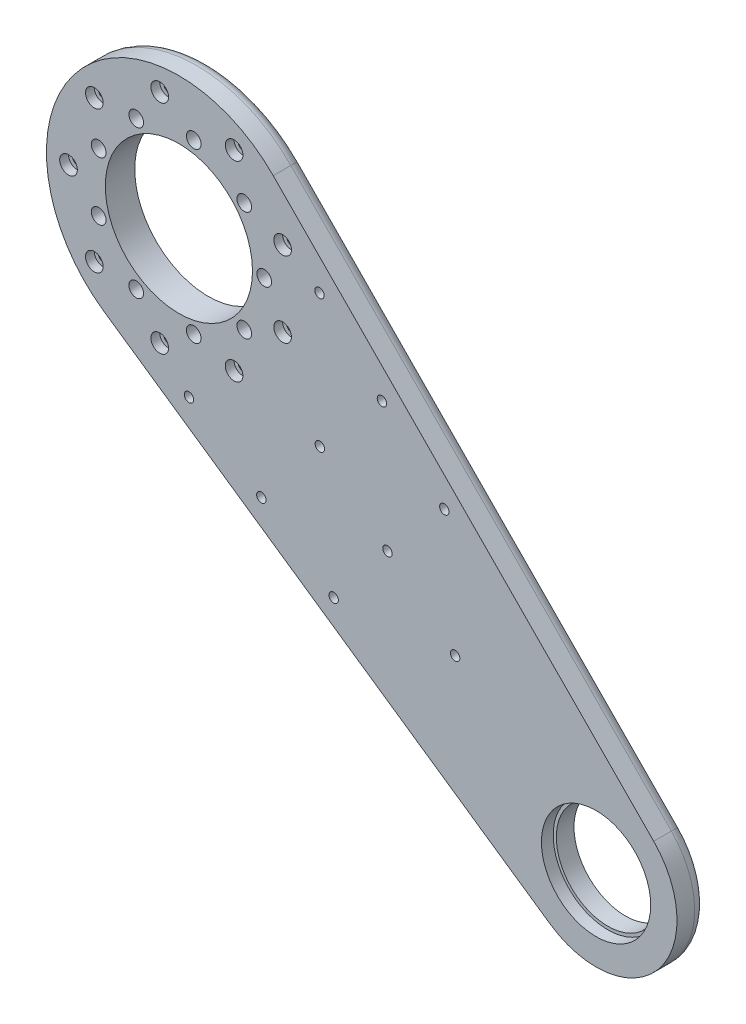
ISO-10303-21;
HEADER;
FILE_DESCRIPTION(('STEP AP214'),'2;1');
FILE_NAME('part.step','',(''),(''),'','','');
FILE_SCHEMA(('AUTOMOTIVE_DESIGN { 1 0 10303 214 1 1 1 1 }'));
ENDSEC;
DATA;
#1=APPLICATION_CONTEXT('core data for automotive mechanical design processes');
#2=APPLICATION_PROTOCOL_DEFINITION('international standard','automotive_design',2000,#1);
#3=PRODUCT_CONTEXT('',#1,'mechanical');
#4=PRODUCT('Part','Part','',(#3));
#5=PRODUCT_RELATED_PRODUCT_CATEGORY('part','',(#4));
#6=PRODUCT_DEFINITION_FORMATION('','',#4);
#7=PRODUCT_DEFINITION_CONTEXT('part definition',#1,'design');
#8=PRODUCT_DEFINITION('design','',#6,#7);
#9=PRODUCT_DEFINITION_SHAPE('','',#8);
#10=(LENGTH_UNIT() NAMED_UNIT(*) SI_UNIT(.MILLI.,.METRE.));
#11=(NAMED_UNIT(*) PLANE_ANGLE_UNIT() SI_UNIT($,.RADIAN.));
#12=(NAMED_UNIT(*) SI_UNIT($,.STERADIAN.) SOLID_ANGLE_UNIT());
#13=UNCERTAINTY_MEASURE_WITH_UNIT(LENGTH_MEASURE(1.E-05),#10,'distance_accuracy_value','');
#14=(GEOMETRIC_REPRESENTATION_CONTEXT(3) GLOBAL_UNCERTAINTY_ASSIGNED_CONTEXT((#13)) GLOBAL_UNIT_ASSIGNED_CONTEXT((#10,
#11,#12)) REPRESENTATION_CONTEXT('',''));
#15=CARTESIAN_POINT('',(0.,0.,0.));
#16=DIRECTION('',(0.,0.,1.));
#17=DIRECTION('',(1.,0.,0.));
#18=AXIS2_PLACEMENT_3D('',#15,#16,#17);
#19=CARTESIAN_POINT('',(18.75,-32.4759526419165,0.));
#20=DIRECTION('',(0.,0.,1.));
#21=DIRECTION('',(1.,0.,0.));
#22=AXIS2_PLACEMENT_3D('',#19,#20,#21);
#23=CYLINDRICAL_SURFACE('',#22,1.6);
#24=CARTESIAN_POINT('',(18.75,-32.4759526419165,0.));
#25=DIRECTION('',(0.,0.,1.));
#26=DIRECTION('',(1.,0.,0.));
#27=AXIS2_PLACEMENT_3D('',#24,#25,#26);
#28=CIRCLE('',#27,1.6);
#29=CARTESIAN_POINT('',(20.35,-32.4759526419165,0.));
#30=VERTEX_POINT('',#29);
#31=EDGE_CURVE('E263',#30,#30,#28,.T.);
#32=ORIENTED_EDGE('',*,*,#31,.F.);
#33=EDGE_LOOP('',(#32));
#34=FACE_BOUND('',#33,.T.);
#35=CARTESIAN_POINT('',(18.75,-32.4759526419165,7.));
#36=DIRECTION('',(0.,0.,1.));
#37=DIRECTION('',(1.,0.,0.));
#38=AXIS2_PLACEMENT_3D('',#35,#36,#37);
#39=CIRCLE('',#38,1.6);
#40=CARTESIAN_POINT('',(20.35,-32.4759526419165,7.));
#41=VERTEX_POINT('',#40);
#42=EDGE_CURVE('E152',#41,#41,#39,.F.);
#43=ORIENTED_EDGE('',*,*,#42,.F.);
#44=EDGE_LOOP('',(#43));
#45=FACE_BOUND('',#44,.T.);
#46=ADVANCED_FACE('F39',(#34,#45),#23,.F.);
#47=CARTESIAN_POINT('',(35.2384732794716,-12.8257553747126,0.));
#48=DIRECTION('',(0.,0.,1.));
#49=DIRECTION('',(1.,0.,0.));
#50=AXIS2_PLACEMENT_3D('',#47,#48,#49);
#51=CYLINDRICAL_SURFACE('',#50,1.6);
#52=CARTESIAN_POINT('',(35.2384732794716,-12.8257553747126,0.));
#53=DIRECTION('',(0.,0.,1.));
#54=DIRECTION('',(1.,0.,0.));
#55=AXIS2_PLACEMENT_3D('',#52,#53,#54);
#56=CIRCLE('',#55,1.6);
#57=CARTESIAN_POINT('',(36.8384732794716,-12.8257553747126,0.));
#58=VERTEX_POINT('',#57);
#59=EDGE_CURVE('E285',#58,#58,#56,.T.);
#60=ORIENTED_EDGE('',*,*,#59,.F.);
#61=EDGE_LOOP('',(#60));
#62=FACE_BOUND('',#61,.T.);
#63=CARTESIAN_POINT('',(35.2384732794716,-12.8257553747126,7.));
#64=DIRECTION('',(0.,0.,1.));
#65=DIRECTION('',(1.,0.,0.));
#66=AXIS2_PLACEMENT_3D('',#63,#64,#65);
#67=CIRCLE('',#66,1.6);
#68=CARTESIAN_POINT('',(36.8384732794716,-12.8257553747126,7.));
#69=VERTEX_POINT('',#68);
#70=EDGE_CURVE('E149',#69,#69,#67,.F.);
#71=ORIENTED_EDGE('',*,*,#70,.F.);
#72=EDGE_LOOP('',(#71));
#73=FACE_BOUND('',#72,.T.);
#74=ADVANCED_FACE('F389',(#62,#73),#51,.F.);
#75=CARTESIAN_POINT('',(35.2384732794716,12.8257553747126,0.));
#76=DIRECTION('',(0.,0.,1.));
#77=DIRECTION('',(1.,0.,0.));
#78=AXIS2_PLACEMENT_3D('',#75,#76,#77);
#79=CYLINDRICAL_SURFACE('',#78,1.6);
#80=CARTESIAN_POINT('',(35.2384732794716,12.8257553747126,0.));
#81=DIRECTION('',(0.,0.,1.));
#82=DIRECTION('',(1.,0.,0.));
#83=AXIS2_PLACEMENT_3D('',#80,#81,#82);
#84=CIRCLE('',#83,1.6);
#85=CARTESIAN_POINT('',(36.8384732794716,12.8257553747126,0.));
#86=VERTEX_POINT('',#85);
#87=EDGE_CURVE('E282',#86,#86,#84,.T.);
#88=ORIENTED_EDGE('',*,*,#87,.F.);
#89=EDGE_LOOP('',(#88));
#90=FACE_BOUND('',#89,.T.);
#91=CARTESIAN_POINT('',(35.2384732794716,12.8257553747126,7.));
#92=DIRECTION('',(0.,0.,1.));
#93=DIRECTION('',(1.,0.,0.));
#94=AXIS2_PLACEMENT_3D('',#91,#92,#93);
#95=CIRCLE('',#94,1.6);
#96=CARTESIAN_POINT('',(36.8384732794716,12.8257553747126,7.));
#97=VERTEX_POINT('',#96);
#98=EDGE_CURVE('E146',#97,#97,#95,.F.);
#99=ORIENTED_EDGE('',*,*,#98,.F.);
#100=EDGE_LOOP('',(#99));
#101=FACE_BOUND('',#100,.T.);
#102=ADVANCED_FACE('F396',(#90,#101),#79,.F.);
#103=CARTESIAN_POINT('',(18.75,32.4759526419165,0.));
#104=DIRECTION('',(0.,0.,1.));
#105=DIRECTION('',(1.,0.,0.));
#106=AXIS2_PLACEMENT_3D('',#103,#104,#105);
#107=CYLINDRICAL_SURFACE('',#106,1.59999999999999);
#108=CARTESIAN_POINT('',(18.75,32.4759526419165,0.));
#109=DIRECTION('',(0.,0.,1.));
#110=DIRECTION('',(1.,0.,0.));
#111=AXIS2_PLACEMENT_3D('',#108,#109,#110);
#112=CIRCLE('',#111,1.59999999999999);
#113=CARTESIAN_POINT('',(20.35,32.4759526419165,0.));
#114=VERTEX_POINT('',#113);
#115=EDGE_CURVE('E278',#114,#114,#112,.T.);
#116=ORIENTED_EDGE('',*,*,#115,.F.);
#117=EDGE_LOOP('',(#116));
#118=FACE_BOUND('',#117,.T.);
#119=CARTESIAN_POINT('',(18.75,32.4759526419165,7.));
#120=DIRECTION('',(0.,0.,1.));
#121=DIRECTION('',(1.,0.,0.));
#122=AXIS2_PLACEMENT_3D('',#119,#120,#121);
#123=CIRCLE('',#122,1.59999999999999);
#124=CARTESIAN_POINT('',(20.35,32.4759526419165,7.));
#125=VERTEX_POINT('',#124);
#126=EDGE_CURVE('E143',#125,#125,#123,.F.);
#127=ORIENTED_EDGE('',*,*,#126,.F.);
#128=EDGE_LOOP('',(#127));
#129=FACE_BOUND('',#128,.T.);
#130=ADVANCED_FACE('F421',(#118,#129),#107,.F.);
#131=CARTESIAN_POINT('',(-6.51180666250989,36.9302907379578,0.));
#132=DIRECTION('',(0.,0.,1.));
#133=DIRECTION('',(1.,0.,0.));
#134=AXIS2_PLACEMENT_3D('',#131,#132,#133);
#135=CYLINDRICAL_SURFACE('',#134,1.59999999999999);
#136=CARTESIAN_POINT('',(-6.51180666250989,36.9302907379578,0.));
#137=DIRECTION('',(0.,0.,1.));
#138=DIRECTION('',(1.,0.,0.));
#139=AXIS2_PLACEMENT_3D('',#136,#137,#138);
#140=CIRCLE('',#139,1.59999999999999);
#141=CARTESIAN_POINT('',(-4.91180666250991,36.9302907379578,0.));
#142=VERTEX_POINT('',#141);
#143=EDGE_CURVE('E281',#142,#142,#140,.T.);
#144=ORIENTED_EDGE('',*,*,#143,.F.);
#145=EDGE_LOOP('',(#144));
#146=FACE_BOUND('',#145,.T.);
#147=CARTESIAN_POINT('',(-6.51180666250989,36.9302907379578,7.));
#148=DIRECTION('',(0.,0.,1.));
#149=DIRECTION('',(1.,0.,0.));
#150=AXIS2_PLACEMENT_3D('',#147,#148,#149);
#151=CIRCLE('',#150,1.59999999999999);
#152=CARTESIAN_POINT('',(-4.91180666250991,36.9302907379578,7.));
#153=VERTEX_POINT('',#152);
#154=EDGE_CURVE('E140',#153,#153,#151,.F.);
#155=ORIENTED_EDGE('',*,*,#154,.F.);
#156=EDGE_LOOP('',(#155));
#157=FACE_BOUND('',#156,.T.);
#158=ADVANCED_FACE('F417',(#146,#157),#135,.F.);
#159=CARTESIAN_POINT('',(-28.7266666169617,24.1045353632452,0.));
#160=DIRECTION('',(0.,0.,1.));
#161=DIRECTION('',(1.,0.,0.));
#162=AXIS2_PLACEMENT_3D('',#159,#160,#161);
#163=CYLINDRICAL_SURFACE('',#162,1.6);
#164=CARTESIAN_POINT('',(-28.7266666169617,24.1045353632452,0.));
#165=DIRECTION('',(0.,0.,1.));
#166=DIRECTION('',(1.,0.,0.));
#167=AXIS2_PLACEMENT_3D('',#164,#165,#166);
#168=CIRCLE('',#167,1.6);
#169=CARTESIAN_POINT('',(-27.1266666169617,24.1045353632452,0.));
#170=VERTEX_POINT('',#169);
#171=EDGE_CURVE('E300',#170,#170,#168,.T.);
#172=ORIENTED_EDGE('',*,*,#171,.F.);
#173=EDGE_LOOP('',(#172));
#174=FACE_BOUND('',#173,.T.);
#175=CARTESIAN_POINT('',(-28.7266666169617,24.1045353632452,7.));
#176=DIRECTION('',(0.,0.,1.));
#177=DIRECTION('',(1.,0.,0.));
#178=AXIS2_PLACEMENT_3D('',#175,#176,#177);
#179=CIRCLE('',#178,1.6);
#180=CARTESIAN_POINT('',(-27.1266666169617,24.1045353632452,7.));
#181=VERTEX_POINT('',#180);
#182=EDGE_CURVE('E137',#181,#181,#179,.F.);
#183=ORIENTED_EDGE('',*,*,#182,.F.);
#184=EDGE_LOOP('',(#183));
#185=FACE_BOUND('',#184,.T.);
#186=ADVANCED_FACE('F413',(#174,#185),#163,.F.);
#187=CARTESIAN_POINT('',(-37.5,0.,0.));
#188=DIRECTION('',(0.,0.,1.));
#189=DIRECTION('',(1.,0.,0.));
#190=AXIS2_PLACEMENT_3D('',#187,#188,#189);
#191=CYLINDRICAL_SURFACE('',#190,1.6);
#192=CARTESIAN_POINT('',(-37.5,0.,0.));
#193=DIRECTION('',(0.,0.,1.));
#194=DIRECTION('',(1.,0.,0.));
#195=AXIS2_PLACEMENT_3D('',#192,#193,#194);
#196=CIRCLE('',#195,1.6);
#197=CARTESIAN_POINT('',(-35.9,0.,0.));
#198=VERTEX_POINT('',#197);
#199=EDGE_CURVE('E297',#198,#198,#196,.T.);
#200=ORIENTED_EDGE('',*,*,#199,.F.);
#201=EDGE_LOOP('',(#200));
#202=FACE_BOUND('',#201,.T.);
#203=CARTESIAN_POINT('',(-37.5,0.,7.));
#204=DIRECTION('',(0.,0.,1.));
#205=DIRECTION('',(1.,0.,0.));
#206=AXIS2_PLACEMENT_3D('',#203,#204,#205);
#207=CIRCLE('',#206,1.6);
#208=CARTESIAN_POINT('',(-35.9,0.,7.));
#209=VERTEX_POINT('',#208);
#210=EDGE_CURVE('E134',#209,#209,#207,.F.);
#211=ORIENTED_EDGE('',*,*,#210,.F.);
#212=EDGE_LOOP('',(#211));
#213=FACE_BOUND('',#212,.T.);
#214=ADVANCED_FACE('F409',(#202,#213),#191,.F.);
#215=CARTESIAN_POINT('',(-28.7266666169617,-24.1045353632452,0.));
#216=DIRECTION('',(0.,0.,1.));
#217=DIRECTION('',(1.,0.,0.));
#218=AXIS2_PLACEMENT_3D('',#215,#216,#217);
#219=CYLINDRICAL_SURFACE('',#218,1.6);
#220=CARTESIAN_POINT('',(-28.7266666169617,-24.1045353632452,0.));
#221=DIRECTION('',(0.,0.,1.));
#222=DIRECTION('',(1.,0.,0.));
#223=AXIS2_PLACEMENT_3D('',#220,#221,#222);
#224=CIRCLE('',#223,1.6);
#225=CARTESIAN_POINT('',(-27.1266666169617,-24.1045353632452,0.));
#226=VERTEX_POINT('',#225);
#227=EDGE_CURVE('E264',#226,#226,#224,.T.);
#228=ORIENTED_EDGE('',*,*,#227,.F.);
#229=EDGE_LOOP('',(#228));
#230=FACE_BOUND('',#229,.T.);
#231=CARTESIAN_POINT('',(-28.7266666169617,-24.1045353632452,7.));
#232=DIRECTION('',(0.,0.,1.));
#233=DIRECTION('',(1.,0.,0.));
#234=AXIS2_PLACEMENT_3D('',#231,#232,#233);
#235=CIRCLE('',#234,1.6);
#236=CARTESIAN_POINT('',(-27.1266666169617,-24.1045353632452,7.));
#237=VERTEX_POINT('',#236);
#238=EDGE_CURVE('E130',#237,#237,#235,.F.);
#239=ORIENTED_EDGE('',*,*,#238,.F.);
#240=EDGE_LOOP('',(#239));
#241=FACE_BOUND('',#240,.T.);
#242=ADVANCED_FACE('F412',(#230,#241),#219,.F.);
#243=CARTESIAN_POINT('',(-6.51180666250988,-36.9302907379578,0.));
#244=DIRECTION('',(0.,0.,1.));
#245=DIRECTION('',(1.,0.,0.));
#246=AXIS2_PLACEMENT_3D('',#243,#244,#245);
#247=CYLINDRICAL_SURFACE('',#246,1.6);
#248=CARTESIAN_POINT('',(-6.51180666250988,-36.9302907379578,0.));
#249=DIRECTION('',(0.,0.,1.));
#250=DIRECTION('',(1.,0.,0.));
#251=AXIS2_PLACEMENT_3D('',#248,#249,#250);
#252=CIRCLE('',#251,1.6);
#253=CARTESIAN_POINT('',(-4.91180666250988,-36.9302907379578,0.));
#254=VERTEX_POINT('',#253);
#255=EDGE_CURVE('E260',#254,#254,#252,.T.);
#256=ORIENTED_EDGE('',*,*,#255,.F.);
#257=EDGE_LOOP('',(#256));
#258=FACE_BOUND('',#257,.T.);
#259=CARTESIAN_POINT('',(-6.51180666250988,-36.9302907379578,7.));
#260=DIRECTION('',(0.,0.,1.));
#261=DIRECTION('',(1.,0.,0.));
#262=AXIS2_PLACEMENT_3D('',#259,#260,#261);
#263=CIRCLE('',#262,1.6);
#264=CARTESIAN_POINT('',(-4.91180666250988,-36.9302907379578,7.));
#265=VERTEX_POINT('',#264);
#266=EDGE_CURVE('E127',#265,#265,#263,.F.);
#267=ORIENTED_EDGE('',*,*,#266,.F.);
#268=EDGE_LOOP('',(#267));
#269=FACE_BOUND('',#268,.T.);
#270=ADVANCED_FACE('F460',(#258,#269),#247,.F.);
#271=CARTESIAN_POINT('',(141.718221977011,-118.91570779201,10.));
#272=DIRECTION('',(0.,0.,-1.));
#273=DIRECTION('',(-1.,0.,0.));
#274=AXIS2_PLACEMENT_3D('',#271,#272,#273);
#275=CYLINDRICAL_SURFACE('',#274,17.5);
#276=CARTESIAN_POINT('',(141.718221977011,-118.91570779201,0.));
#277=DIRECTION('',(0.,0.,1.));
#278=DIRECTION('',(1.,0.,0.));
#279=AXIS2_PLACEMENT_3D('',#276,#277,#278);
#280=CIRCLE('',#279,17.5);
#281=CARTESIAN_POINT('',(159.218221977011,-118.91570779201,0.));
#282=VERTEX_POINT('',#281);
#283=EDGE_CURVE('E350',#282,#282,#280,.T.);
#284=ORIENTED_EDGE('',*,*,#283,.F.);
#285=EDGE_LOOP('',(#284));
#286=FACE_BOUND('',#285,.T.);
#287=CARTESIAN_POINT('',(141.718221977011,-118.91570779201,6.));
#288=DIRECTION('',(0.,0.,1.));
#289=DIRECTION('',(1.,0.,0.));
#290=AXIS2_PLACEMENT_3D('',#287,#288,#289);
#291=CIRCLE('',#290,17.5);
#292=CARTESIAN_POINT('',(159.218221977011,-118.91570779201,6.));
#293=VERTEX_POINT('',#292);
#294=EDGE_CURVE('E122',#293,#293,#291,.T.);
#295=ORIENTED_EDGE('',*,*,#294,.T.);
#296=EDGE_LOOP('',(#295));
#297=FACE_BOUND('',#296,.T.);
#298=ADVANCED_FACE('F457',(#286,#297),#275,.F.);
#299=CARTESIAN_POINT('',(0.,0.,10.));
#300=DIRECTION('',(0.,0.,1.));
#301=DIRECTION('',(1.,0.,0.));
#302=AXIS2_PLACEMENT_3D('',#299,#300,#301);
#303=PLANE('',#302);
#304=CARTESIAN_POINT('',(-6.51180666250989,36.9302907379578,10.));
#305=DIRECTION('',(0.,0.,1.));
#306=DIRECTION('',(1.,0.,0.));
#307=AXIS2_PLACEMENT_3D('',#304,#305,#306);
#308=CIRCLE('',#307,3.);
#309=CARTESIAN_POINT('',(-3.51180666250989,36.9302907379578,10.));
#310=VERTEX_POINT('',#309);
#311=EDGE_CURVE('E190',#310,#310,#308,.T.);
#312=ORIENTED_EDGE('',*,*,#311,.F.);
#313=EDGE_LOOP('',(#312));
#314=FACE_BOUND('',#313,.T.);
#315=CARTESIAN_POINT('',(18.75,32.4759526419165,10.));
#316=DIRECTION('',(0.,0.,1.));
#317=DIRECTION('',(1.,0.,0.));
#318=AXIS2_PLACEMENT_3D('',#315,#316,#317);
#319=CIRCLE('',#318,3.);
#320=CARTESIAN_POINT('',(21.75,32.4759526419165,10.));
#321=VERTEX_POINT('',#320);
#322=EDGE_CURVE('E197',#321,#321,#319,.T.);
#323=ORIENTED_EDGE('',*,*,#322,.F.);
#324=EDGE_LOOP('',(#323));
#325=FACE_BOUND('',#324,.T.);
#326=CARTESIAN_POINT('',(35.2384732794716,12.8257553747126,10.));
#327=DIRECTION('',(0.,0.,1.));
#328=DIRECTION('',(1.,0.,0.));
#329=AXIS2_PLACEMENT_3D('',#326,#327,#328);
#330=CIRCLE('',#329,3.);
#331=CARTESIAN_POINT('',(38.2384732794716,12.8257553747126,10.));
#332=VERTEX_POINT('',#331);
#333=EDGE_CURVE('E203',#332,#332,#330,.T.);
#334=ORIENTED_EDGE('',*,*,#333,.F.);
#335=EDGE_LOOP('',(#334));
#336=FACE_BOUND('',#335,.T.);
#337=CARTESIAN_POINT('',(35.2384732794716,-12.8257553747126,10.));
#338=DIRECTION('',(0.,0.,1.));
#339=DIRECTION('',(1.,0.,0.));
#340=AXIS2_PLACEMENT_3D('',#337,#338,#339);
#341=CIRCLE('',#340,3.);
#342=CARTESIAN_POINT('',(38.2384732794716,-12.8257553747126,10.));
#343=VERTEX_POINT('',#342);
#344=EDGE_CURVE('E209',#343,#343,#341,.T.);
#345=ORIENTED_EDGE('',*,*,#344,.F.);
#346=EDGE_LOOP('',(#345));
#347=FACE_BOUND('',#346,.T.);
#348=CARTESIAN_POINT('',(18.75,-32.4759526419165,10.));
#349=DIRECTION('',(0.,0.,1.));
#350=DIRECTION('',(1.,0.,0.));
#351=AXIS2_PLACEMENT_3D('',#348,#349,#350);
#352=CIRCLE('',#351,3.);
#353=CARTESIAN_POINT('',(21.75,-32.4759526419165,10.));
#354=VERTEX_POINT('',#353);
#355=EDGE_CURVE('E215',#354,#354,#352,.T.);
#356=ORIENTED_EDGE('',*,*,#355,.F.);
#357=EDGE_LOOP('',(#356));
#358=FACE_BOUND('',#357,.T.);
#359=CARTESIAN_POINT('',(-6.51180666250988,-36.9302907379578,10.));
#360=DIRECTION('',(0.,0.,1.));
#361=DIRECTION('',(1.,0.,0.));
#362=AXIS2_PLACEMENT_3D('',#359,#360,#361);
#363=CIRCLE('',#362,3.);
#364=CARTESIAN_POINT('',(-3.51180666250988,-36.9302907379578,10.));
#365=VERTEX_POINT('',#364);
#366=EDGE_CURVE('E1091',#365,#365,#363,.T.);
#367=ORIENTED_EDGE('',*,*,#366,.F.);
#368=EDGE_LOOP('',(#367));
#369=FACE_BOUND('',#368,.T.);
#370=CARTESIAN_POINT('',(-28.7266666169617,-24.1045353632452,10.));
#371=DIRECTION('',(0.,0.,1.));
#372=DIRECTION('',(1.,0.,0.));
#373=AXIS2_PLACEMENT_3D('',#370,#371,#372);
#374=CIRCLE('',#373,3.);
#375=CARTESIAN_POINT('',(-25.7266666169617,-24.1045353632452,10.));
#376=VERTEX_POINT('',#375);
#377=EDGE_CURVE('E1092',#376,#376,#374,.T.);
#378=ORIENTED_EDGE('',*,*,#377,.F.);
#379=EDGE_LOOP('',(#378));
#380=FACE_BOUND('',#379,.T.);
#381=CARTESIAN_POINT('',(-37.5,0.,10.));
#382=DIRECTION('',(0.,0.,1.));
#383=DIRECTION('',(1.,0.,0.));
#384=AXIS2_PLACEMENT_3D('',#381,#382,#383);
#385=CIRCLE('',#384,3.);
#386=CARTESIAN_POINT('',(-34.5,0.,10.));
#387=VERTEX_POINT('',#386);
#388=EDGE_CURVE('E181',#387,#387,#385,.T.);
#389=ORIENTED_EDGE('',*,*,#388,.F.);
#390=EDGE_LOOP('',(#389));
#391=FACE_BOUND('',#390,.T.);
#392=CARTESIAN_POINT('',(-28.7266666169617,24.1045353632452,10.));
#393=DIRECTION('',(0.,0.,1.));
#394=DIRECTION('',(1.,0.,0.));
#395=AXIS2_PLACEMENT_3D('',#392,#393,#394);
#396=CIRCLE('',#395,3.);
#397=CARTESIAN_POINT('',(-25.7266666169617,24.1045353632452,10.));
#398=VERTEX_POINT('',#397);
#399=EDGE_CURVE('E193',#398,#398,#396,.T.);
#400=ORIENTED_EDGE('',*,*,#399,.F.);
#401=EDGE_LOOP('',(#400));
#402=FACE_BOUND('',#401,.T.);
#403=CARTESIAN_POINT('',(141.718221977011,-118.91570779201,10.));
#404=DIRECTION('',(0.,0.,1.));
#405=DIRECTION('',(1.,0.,0.));
#406=AXIS2_PLACEMENT_3D('',#403,#404,#405);
#407=CIRCLE('',#406,18.5625);
#408=CARTESIAN_POINT('',(160.280721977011,-118.91570779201,10.));
#409=VERTEX_POINT('',#408);
#410=EDGE_CURVE('E154',#409,#409,#407,.T.);
#411=ORIENTED_EDGE('',*,*,#410,.F.);
#412=EDGE_LOOP('',(#411));
#413=FACE_BOUND('',#412,.T.);
#414=CARTESIAN_POINT('',(22.2152888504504,-18.6408406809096,10.));
#415=DIRECTION('',(0.,0.,1.));
#416=DIRECTION('',(1.,0.,0.));
#417=AXIS2_PLACEMENT_3D('',#414,#415,#416);
#418=CIRCLE('',#417,2.5);
#419=CARTESIAN_POINT('',(24.7152888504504,-18.6408406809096,10.));
#420=VERTEX_POINT('',#419);
#421=EDGE_CURVE('E267',#420,#420,#418,.T.);
#422=ORIENTED_EDGE('',*,*,#421,.F.);
#423=EDGE_LOOP('',(#422));
#424=FACE_BOUND('',#423,.T.);
#425=CARTESIAN_POINT('',(5.03579715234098,-28.559424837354,10.));
#426=DIRECTION('',(0.,0.,1.));
#427=DIRECTION('',(1.,0.,0.));
#428=AXIS2_PLACEMENT_3D('',#425,#426,#427);
#429=CIRCLE('',#428,2.5);
#430=CARTESIAN_POINT('',(7.53579715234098,-28.559424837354,10.));
#431=VERTEX_POINT('',#430);
#432=EDGE_CURVE('E273',#431,#431,#429,.T.);
#433=ORIENTED_EDGE('',*,*,#432,.F.);
#434=EDGE_LOOP('',(#433));
#435=FACE_BOUND('',#434,.T.);
#436=CARTESIAN_POINT('',(-14.5,-25.1147367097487,10.));
#437=DIRECTION('',(0.,0.,1.));
#438=DIRECTION('',(1.,0.,0.));
#439=AXIS2_PLACEMENT_3D('',#436,#437,#438);
#440=CIRCLE('',#439,2.5);
#441=CARTESIAN_POINT('',(-12.,-25.1147367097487,10.));
#442=VERTEX_POINT('',#441);
#443=EDGE_CURVE('E236',#442,#442,#440,.T.);
#444=ORIENTED_EDGE('',*,*,#443,.F.);
#445=EDGE_LOOP('',(#444));
#446=FACE_BOUND('',#445,.T.);
#447=CARTESIAN_POINT('',(-27.2510860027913,-9.9185841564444,10.));
#448=DIRECTION('',(0.,0.,1.));
#449=DIRECTION('',(1.,0.,0.));
#450=AXIS2_PLACEMENT_3D('',#447,#448,#449);
#451=CIRCLE('',#450,2.5);
#452=CARTESIAN_POINT('',(-24.7510860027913,-9.9185841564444,10.));
#453=VERTEX_POINT('',#452);
#454=EDGE_CURVE('E243',#453,#453,#451,.T.);
#455=ORIENTED_EDGE('',*,*,#454,.F.);
#456=EDGE_LOOP('',(#455));
#457=FACE_BOUND('',#456,.T.);
#458=CARTESIAN_POINT('',(-27.2510860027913,9.91858415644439,10.));
#459=DIRECTION('',(0.,0.,1.));
#460=DIRECTION('',(1.,0.,0.));
#461=AXIS2_PLACEMENT_3D('',#458,#459,#460);
#462=CIRCLE('',#461,2.5);
#463=CARTESIAN_POINT('',(-24.7510860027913,9.91858415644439,10.));
#464=VERTEX_POINT('',#463);
#465=EDGE_CURVE('E249',#464,#464,#462,.T.);
#466=ORIENTED_EDGE('',*,*,#465,.F.);
#467=EDGE_LOOP('',(#466));
#468=FACE_BOUND('',#467,.T.);
#469=CARTESIAN_POINT('',(-14.5,25.1147367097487,10.));
#470=DIRECTION('',(0.,0.,1.));
#471=DIRECTION('',(1.,0.,0.));
#472=AXIS2_PLACEMENT_3D('',#469,#470,#471);
#473=CIRCLE('',#472,2.5);
#474=CARTESIAN_POINT('',(-12.,25.1147367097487,10.));
#475=VERTEX_POINT('',#474);
#476=EDGE_CURVE('E255',#475,#475,#473,.T.);
#477=ORIENTED_EDGE('',*,*,#476,.F.);
#478=EDGE_LOOP('',(#477));
#479=FACE_BOUND('',#478,.T.);
#480=CARTESIAN_POINT('',(29.,0.,10.));
#481=DIRECTION('',(0.,0.,1.));
#482=DIRECTION('',(1.,0.,0.));
#483=AXIS2_PLACEMENT_3D('',#480,#481,#482);
#484=CIRCLE('',#483,2.5);
#485=CARTESIAN_POINT('',(31.5,0.,10.));
#486=VERTEX_POINT('',#485);
#487=EDGE_CURVE('E290',#486,#486,#484,.T.);
#488=ORIENTED_EDGE('',*,*,#487,.F.);
#489=EDGE_LOOP('',(#488));
#490=FACE_BOUND('',#489,.T.);
#491=CARTESIAN_POINT('',(5.03579715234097,28.559424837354,10.));
#492=DIRECTION('',(0.,0.,1.));
#493=DIRECTION('',(1.,0.,0.));
#494=AXIS2_PLACEMENT_3D('',#491,#492,#493);
#495=CIRCLE('',#494,2.5);
#496=CARTESIAN_POINT('',(7.53579715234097,28.559424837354,10.));
#497=VERTEX_POINT('',#496);
#498=EDGE_CURVE('E224',#497,#497,#495,.T.);
#499=ORIENTED_EDGE('',*,*,#498,.F.);
#500=EDGE_LOOP('',(#499));
#501=FACE_BOUND('',#500,.T.);
#502=CARTESIAN_POINT('',(22.2152888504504,18.6408406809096,10.));
#503=DIRECTION('',(0.,0.,1.));
#504=DIRECTION('',(1.,0.,0.));
#505=AXIS2_PLACEMENT_3D('',#502,#503,#504);
#506=CIRCLE('',#505,2.5);
#507=CARTESIAN_POINT('',(24.7152888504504,18.6408406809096,10.));
#508=VERTEX_POINT('',#507);
#509=EDGE_CURVE('E231',#508,#508,#506,.T.);
#510=ORIENTED_EDGE('',*,*,#509,.F.);
#511=EDGE_LOOP('',(#510));
#512=FACE_BOUND('',#511,.T.);
#513=CARTESIAN_POINT('',(0.,0.,10.));
#514=DIRECTION('',(0.,0.,1.));
#515=DIRECTION('',(1.,0.,0.));
#516=AXIS2_PLACEMENT_3D('',#513,#514,#515);
#517=CIRCLE('',#516,25.);
#518=CARTESIAN_POINT('',(25.,0.,10.));
#519=VERTEX_POINT('',#518);
#520=EDGE_CURVE('E293',#519,#519,#517,.T.);
#521=ORIENTED_EDGE('',*,*,#520,.F.);
#522=EDGE_LOOP('',(#521));
#523=FACE_BOUND('',#522,.T.);
#524=CARTESIAN_POINT('',(90.179732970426,-37.4944400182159,10.));
#525=DIRECTION('',(0.,0.,1.));
#526=DIRECTION('',(1.,0.,0.));
#527=AXIS2_PLACEMENT_3D('',#524,#525,#526);
#528=CIRCLE('',#527,1.59999999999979);
#529=CARTESIAN_POINT('',(91.7797329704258,-37.4944400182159,10.));
#530=VERTEX_POINT('',#529);
#531=EDGE_CURVE('E317',#530,#530,#528,.T.);
#532=ORIENTED_EDGE('',*,*,#531,.F.);
#533=EDGE_LOOP('',(#532));
#534=FACE_BOUND('',#533,.T.);
#535=CARTESIAN_POINT('',(28.0038552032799,-65.1000593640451,10.));
#536=DIRECTION('',(0.,0.,1.));
#537=DIRECTION('',(1.,0.,0.));
#538=AXIS2_PLACEMENT_3D('',#535,#536,#537);
#539=CIRCLE('',#538,1.59999999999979);
#540=CARTESIAN_POINT('',(29.6038552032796,-65.1000593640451,10.));
#541=VERTEX_POINT('',#540);
#542=EDGE_CURVE('E329',#541,#541,#539,.T.);
#543=ORIENTED_EDGE('',*,*,#542,.F.);
#544=EDGE_LOOP('',(#543));
#545=FACE_BOUND('',#544,.T.);
#546=CARTESIAN_POINT('',(47.7679902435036,4.94662593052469,10.));
#547=DIRECTION('',(0.,0.,1.));
#548=DIRECTION('',(1.,0.,0.));
#549=AXIS2_PLACEMENT_3D('',#546,#547,#548);
#550=CIRCLE('',#549,1.59999999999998);
#551=CARTESIAN_POINT('',(49.3679902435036,4.94662593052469,10.));
#552=VERTEX_POINT('',#551);
#553=EDGE_CURVE('E341',#552,#552,#550,.T.);
#554=ORIENTED_EDGE('',*,*,#553,.F.);
#555=EDGE_LOOP('',(#554));
#556=FACE_BOUND('',#555,.T.);
#557=CARTESIAN_POINT('',(70.8591109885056,-59.4578538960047,10.));
#558=DIRECTION('',(0.,0.,1.));
#559=DIRECTION('',(1.,0.,0.));
#560=AXIS2_PLACEMENT_3D('',#557,#558,#559);
#561=CIRCLE('',#560,1.59999999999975);
#562=CARTESIAN_POINT('',(72.4591109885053,-59.4578538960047,10.));
#563=VERTEX_POINT('',#562);
#564=EDGE_CURVE('E110',#563,#563,#561,.T.);
#565=ORIENTED_EDGE('',*,*,#564,.F.);
#566=EDGE_LOOP('',(#565));
#567=FACE_BOUND('',#566,.T.);
#568=CARTESIAN_POINT('',(0.,0.,10.));
#569=DIRECTION('',(0.,0.,1.));
#570=DIRECTION('',(1.,0.,0.));
#571=AXIS2_PLACEMENT_3D('',#568,#569,#570);
#572=CIRCLE('',#571,45.);
#573=CARTESIAN_POINT('',(32.0566020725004,31.58123277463,10.));
#574=VERTEX_POINT('',#573);
#575=CARTESIAN_POINT('',(-25.5348723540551,-37.0536137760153,10.));
#576=VERTEX_POINT('',#575);
#577=EDGE_CURVE('E103',#574,#576,#572,.T.);
#578=ORIENTED_EDGE('',*,*,#577,.T.);
#579=DIRECTION('',(0.823413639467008,-0.56744160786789,0.));
#580=VECTOR('',#579,1.);
#581=CARTESIAN_POINT('',(-25.5348723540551,-37.0536137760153,10.));
#582=LINE('',#581,#580);
#583=CARTESIAN_POINT('',(126.113577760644,-141.559582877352,10.));
#584=VERTEX_POINT('',#583);
#585=EDGE_CURVE('E93',#576,#584,#582,.T.);
#586=ORIENTED_EDGE('',*,*,#585,.T.);
#587=CARTESIAN_POINT('',(141.718221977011,-118.91570779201,10.));
#588=DIRECTION('',(0.,0.,1.));
#589=DIRECTION('',(1.,0.,0.));
#590=AXIS2_PLACEMENT_3D('',#587,#588,#589);
#591=CIRCLE('',#590,27.5);
#592=CARTESIAN_POINT('',(161.308367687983,-99.6160655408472,10.));
#593=VERTEX_POINT('',#592);
#594=EDGE_CURVE('E102',#584,#593,#591,.T.);
#595=ORIENTED_EDGE('',*,*,#594,.T.);
#596=DIRECTION('',(-0.701805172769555,0.712368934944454,0.));
#597=VECTOR('',#596,1.);
#598=CARTESIAN_POINT('',(32.0566020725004,31.58123277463,10.));
#599=LINE('',#598,#597);
#600=EDGE_CURVE('E109',#593,#574,#599,.T.);
#601=ORIENTED_EDGE('',*,*,#600,.T.);
#602=EDGE_LOOP('',(#578,#586,#595,#601));
#603=FACE_BOUND('',#602,.T.);
#604=CARTESIAN_POINT('',(47.8777776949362,-40.1742256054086,10.));
#605=DIRECTION('',(0.,0.,1.));
#606=DIRECTION('',(1.,0.,0.));
#607=AXIS2_PLACEMENT_3D('',#604,#605,#606);
#608=CIRCLE('',#607,1.59999999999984);
#609=CARTESIAN_POINT('',(49.477777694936,-40.1742256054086,10.));
#610=VERTEX_POINT('',#609);
#611=EDGE_CURVE('E356',#610,#610,#608,.T.);
#612=ORIENTED_EDGE('',*,*,#611,.F.);
#613=EDGE_LOOP('',(#612));
#614=FACE_BOUND('',#613,.T.);
#615=CARTESIAN_POINT('',(93.840444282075,-78.7414821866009,10.));
#616=DIRECTION('',(0.,0.,1.));
#617=DIRECTION('',(1.,0.,0.));
#618=AXIS2_PLACEMENT_3D('',#615,#616,#617);
#619=CIRCLE('',#618,1.59999999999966);
#620=CARTESIAN_POINT('',(95.4404442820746,-78.7414821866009,10.));
#621=VERTEX_POINT('',#620);
#622=EDGE_CURVE('E347',#621,#621,#619,.T.);
#623=ORIENTED_EDGE('',*,*,#622,.F.);
#624=EDGE_LOOP('',(#623));
#625=FACE_BOUND('',#624,.T.);
#626=CARTESIAN_POINT('',(3.42334888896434,-47.9012597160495,10.));
#627=DIRECTION('',(0.,0.,1.));
#628=DIRECTION('',(1.,0.,0.));
#629=AXIS2_PLACEMENT_3D('',#626,#627,#628);
#630=CIRCLE('',#629,1.59999999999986);
#631=CARTESIAN_POINT('',(5.0233488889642,-47.9012597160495,10.));
#632=VERTEX_POINT('',#631);
#633=EDGE_CURVE('E335',#632,#632,#630,.T.);
#634=ORIENTED_EDGE('',*,*,#633,.F.);
#635=EDGE_LOOP('',(#634));
#636=FACE_BOUND('',#635,.T.);
#637=CARTESIAN_POINT('',(68.9738616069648,-16.2739070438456,10.));
#638=DIRECTION('',(0.,0.,1.));
#639=DIRECTION('',(1.,0.,0.));
#640=AXIS2_PLACEMENT_3D('',#637,#638,#639);
#641=CIRCLE('',#640,1.5999999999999);
#642=CARTESIAN_POINT('',(70.5738616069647,-16.2739070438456,10.));
#643=VERTEX_POINT('',#642);
#644=EDGE_CURVE('E323',#643,#643,#641,.T.);
#645=ORIENTED_EDGE('',*,*,#644,.F.);
#646=EDGE_LOOP('',(#645));
#647=FACE_BOUND('',#646,.T.);
#648=CARTESIAN_POINT('',(52.5843615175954,-82.2988590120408,10.));
#649=DIRECTION('',(0.,0.,1.));
#650=DIRECTION('',(1.,0.,0.));
#651=AXIS2_PLACEMENT_3D('',#648,#649,#650);
#652=CIRCLE('',#651,1.5999999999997);
#653=CARTESIAN_POINT('',(54.1843615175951,-82.2988590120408,10.));
#654=VERTEX_POINT('',#653);
#655=EDGE_CURVE('E311',#654,#654,#652,.T.);
#656=ORIENTED_EDGE('',*,*,#655,.F.);
#657=EDGE_LOOP('',(#656));
#658=FACE_BOUND('',#657,.T.);
#659=ADVANCED_FACE('F106',(#314,#325,#336,#347,#358,#369,#380,#391,#402,#413,#424,#435,#446,
#457,#468,#479,#490,#501,#512,#523,#534,#545,#556,#567,#603,#614,#625,#636,#647,#658),#303,.T.);
#660=CARTESIAN_POINT('',(0.,0.,0.));
#661=DIRECTION('',(0.,0.,1.));
#662=DIRECTION('',(1.,0.,0.));
#663=AXIS2_PLACEMENT_3D('',#660,#661,#662);
#664=PLANE('',#663);
#665=DIRECTION('',(-0.701805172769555,0.712368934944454,0.));
#666=VECTOR('',#665,1.);
#667=CARTESIAN_POINT('',(29.2071263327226,28.7740120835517,0.));
#668=LINE('',#667,#666);
#669=CARTESIAN_POINT('',(29.2071263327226,28.7740120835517,0.));
#670=VERTEX_POINT('',#669);
#671=CARTESIAN_POINT('',(158.458891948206,-102.423286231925,0.));
#672=VERTEX_POINT('',#671);
#673=EDGE_CURVE('E116',#670,#672,#668,.F.);
#674=ORIENTED_EDGE('',*,*,#673,.T.);
#675=CARTESIAN_POINT('',(141.718221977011,-118.91570779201,0.));
#676=DIRECTION('',(0.,0.,1.));
#677=DIRECTION('',(1.,0.,0.));
#678=AXIS2_PLACEMENT_3D('',#675,#676,#677);
#679=CIRCLE('',#678,23.5);
#680=CARTESIAN_POINT('',(128.383344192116,-138.265928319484,0.));
#681=VERTEX_POINT('',#680);
#682=EDGE_CURVE('E161',#672,#681,#679,.F.);
#683=ORIENTED_EDGE('',*,*,#682,.T.);
#684=DIRECTION('',(0.823413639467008,-0.56744160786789,0.));
#685=VECTOR('',#684,1.);
#686=CARTESIAN_POINT('',(-23.2651059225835,-33.7599592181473,0.));
#687=LINE('',#686,#685);
#688=CARTESIAN_POINT('',(-23.2651059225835,-33.7599592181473,0.));
#689=VERTEX_POINT('',#688);
#690=EDGE_CURVE('E159',#681,#689,#687,.F.);
#691=ORIENTED_EDGE('',*,*,#690,.T.);
#692=CARTESIAN_POINT('',(0.,0.,0.));
#693=DIRECTION('',(0.,0.,1.));
#694=DIRECTION('',(1.,0.,0.));
#695=AXIS2_PLACEMENT_3D('',#692,#693,#694);
#696=CIRCLE('',#695,41.);
#697=EDGE_CURVE('E157',#689,#670,#696,.F.);
#698=ORIENTED_EDGE('',*,*,#697,.T.);
#699=EDGE_LOOP('',(#674,#683,#691,#698));
#700=FACE_BOUND('',#699,.T.);
#701=ORIENTED_EDGE('',*,*,#255,.T.);
#702=EDGE_LOOP('',(#701));
#703=FACE_BOUND('',#702,.T.);
#704=ORIENTED_EDGE('',*,*,#227,.T.);
#705=EDGE_LOOP('',(#704));
#706=FACE_BOUND('',#705,.T.);
#707=CARTESIAN_POINT('',(22.2152888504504,-18.6408406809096,0.));
#708=DIRECTION('',(0.,0.,1.));
#709=DIRECTION('',(1.,0.,0.));
#710=AXIS2_PLACEMENT_3D('',#707,#708,#709);
#711=CIRCLE('',#710,2.5);
#712=CARTESIAN_POINT('',(24.7152888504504,-18.6408406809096,0.));
#713=VERTEX_POINT('',#712);
#714=EDGE_CURVE('E270',#713,#713,#711,.T.);
#715=ORIENTED_EDGE('',*,*,#714,.T.);
#716=EDGE_LOOP('',(#715));
#717=FACE_BOUND('',#716,.T.);
#718=CARTESIAN_POINT('',(5.03579715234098,-28.559424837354,0.));
#719=DIRECTION('',(0.,0.,1.));
#720=DIRECTION('',(1.,0.,0.));
#721=AXIS2_PLACEMENT_3D('',#718,#719,#720);
#722=CIRCLE('',#721,2.5);
#723=CARTESIAN_POINT('',(7.53579715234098,-28.559424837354,0.));
#724=VERTEX_POINT('',#723);
#725=EDGE_CURVE('E239',#724,#724,#722,.T.);
#726=ORIENTED_EDGE('',*,*,#725,.T.);
#727=EDGE_LOOP('',(#726));
#728=FACE_BOUND('',#727,.T.);
#729=CARTESIAN_POINT('',(-14.5,-25.1147367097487,0.));
#730=DIRECTION('',(0.,0.,1.));
#731=DIRECTION('',(1.,0.,0.));
#732=AXIS2_PLACEMENT_3D('',#729,#730,#731);
#733=CIRCLE('',#732,2.5);
#734=CARTESIAN_POINT('',(-12.,-25.1147367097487,0.));
#735=VERTEX_POINT('',#734);
#736=EDGE_CURVE('E240',#735,#735,#733,.T.);
#737=ORIENTED_EDGE('',*,*,#736,.T.);
#738=EDGE_LOOP('',(#737));
#739=FACE_BOUND('',#738,.T.);
#740=CARTESIAN_POINT('',(-27.2510860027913,-9.9185841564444,0.));
#741=DIRECTION('',(0.,0.,1.));
#742=DIRECTION('',(1.,0.,0.));
#743=AXIS2_PLACEMENT_3D('',#740,#741,#742);
#744=CIRCLE('',#743,2.5);
#745=CARTESIAN_POINT('',(-24.7510860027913,-9.9185841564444,0.));
#746=VERTEX_POINT('',#745);
#747=EDGE_CURVE('E246',#746,#746,#744,.T.);
#748=ORIENTED_EDGE('',*,*,#747,.T.);
#749=EDGE_LOOP('',(#748));
#750=FACE_BOUND('',#749,.T.);
#751=CARTESIAN_POINT('',(-27.2510860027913,9.91858415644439,0.));
#752=DIRECTION('',(0.,0.,1.));
#753=DIRECTION('',(1.,0.,0.));
#754=AXIS2_PLACEMENT_3D('',#751,#752,#753);
#755=CIRCLE('',#754,2.5);
#756=CARTESIAN_POINT('',(-24.7510860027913,9.91858415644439,0.));
#757=VERTEX_POINT('',#756);
#758=EDGE_CURVE('E252',#757,#757,#755,.T.);
#759=ORIENTED_EDGE('',*,*,#758,.T.);
#760=EDGE_LOOP('',(#759));
#761=FACE_BOUND('',#760,.T.);
#762=CARTESIAN_POINT('',(-14.5,25.1147367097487,0.));
#763=DIRECTION('',(0.,0.,1.));
#764=DIRECTION('',(1.,0.,0.));
#765=AXIS2_PLACEMENT_3D('',#762,#763,#764);
#766=CIRCLE('',#765,2.5);
#767=CARTESIAN_POINT('',(-12.,25.1147367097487,0.));
#768=VERTEX_POINT('',#767);
#769=EDGE_CURVE('E227',#768,#768,#766,.T.);
#770=ORIENTED_EDGE('',*,*,#769,.T.);
#771=EDGE_LOOP('',(#770));
#772=FACE_BOUND('',#771,.T.);
#773=CARTESIAN_POINT('',(29.,0.,0.));
#774=DIRECTION('',(0.,0.,1.));
#775=DIRECTION('',(1.,0.,0.));
#776=AXIS2_PLACEMENT_3D('',#773,#774,#775);
#777=CIRCLE('',#776,2.5);
#778=CARTESIAN_POINT('',(31.5,0.,0.));
#779=VERTEX_POINT('',#778);
#780=EDGE_CURVE('E294',#779,#779,#777,.T.);
#781=ORIENTED_EDGE('',*,*,#780,.T.);
#782=EDGE_LOOP('',(#781));
#783=FACE_BOUND('',#782,.T.);
#784=ORIENTED_EDGE('',*,*,#199,.T.);
#785=EDGE_LOOP('',(#784));
#786=FACE_BOUND('',#785,.T.);
#787=ORIENTED_EDGE('',*,*,#171,.T.);
#788=EDGE_LOOP('',(#787));
#789=FACE_BOUND('',#788,.T.);
#790=ORIENTED_EDGE('',*,*,#143,.T.);
#791=EDGE_LOOP('',(#790));
#792=FACE_BOUND('',#791,.T.);
#793=ORIENTED_EDGE('',*,*,#115,.T.);
#794=EDGE_LOOP('',(#793));
#795=FACE_BOUND('',#794,.T.);
#796=ORIENTED_EDGE('',*,*,#87,.T.);
#797=EDGE_LOOP('',(#796));
#798=FACE_BOUND('',#797,.T.);
#799=ORIENTED_EDGE('',*,*,#59,.T.);
#800=EDGE_LOOP('',(#799));
#801=FACE_BOUND('',#800,.T.);
#802=ORIENTED_EDGE('',*,*,#31,.T.);
#803=EDGE_LOOP('',(#802));
#804=FACE_BOUND('',#803,.T.);
#805=CARTESIAN_POINT('',(5.03579715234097,28.559424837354,0.));
#806=DIRECTION('',(0.,0.,1.));
#807=DIRECTION('',(1.,0.,0.));
#808=AXIS2_PLACEMENT_3D('',#805,#806,#807);
#809=CIRCLE('',#808,2.5);
#810=CARTESIAN_POINT('',(7.53579715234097,28.559424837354,0.));
#811=VERTEX_POINT('',#810);
#812=EDGE_CURVE('E228',#811,#811,#809,.T.);
#813=ORIENTED_EDGE('',*,*,#812,.T.);
#814=EDGE_LOOP('',(#813));
#815=FACE_BOUND('',#814,.T.);
#816=CARTESIAN_POINT('',(22.2152888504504,18.6408406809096,0.));
#817=DIRECTION('',(0.,0.,1.));
#818=DIRECTION('',(1.,0.,0.));
#819=AXIS2_PLACEMENT_3D('',#816,#817,#818);
#820=CIRCLE('',#819,2.5);
#821=CARTESIAN_POINT('',(24.7152888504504,18.6408406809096,0.));
#822=VERTEX_POINT('',#821);
#823=EDGE_CURVE('E125',#822,#822,#820,.T.);
#824=ORIENTED_EDGE('',*,*,#823,.T.);
#825=EDGE_LOOP('',(#824));
#826=FACE_BOUND('',#825,.T.);
#827=CARTESIAN_POINT('',(0.,0.,0.));
#828=DIRECTION('',(0.,0.,1.));
#829=DIRECTION('',(1.,0.,0.));
#830=AXIS2_PLACEMENT_3D('',#827,#828,#829);
#831=CIRCLE('',#830,25.);
#832=CARTESIAN_POINT('',(25.,0.,0.));
#833=VERTEX_POINT('',#832);
#834=EDGE_CURVE('E305',#833,#833,#831,.T.);
#835=ORIENTED_EDGE('',*,*,#834,.T.);
#836=EDGE_LOOP('',(#835));
#837=FACE_BOUND('',#836,.T.);
#838=CARTESIAN_POINT('',(70.8591109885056,-59.4578538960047,0.));
#839=DIRECTION('',(0.,0.,1.));
#840=DIRECTION('',(1.,0.,0.));
#841=AXIS2_PLACEMENT_3D('',#838,#839,#840);
#842=CIRCLE('',#841,1.59999999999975);
#843=CARTESIAN_POINT('',(72.4591109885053,-59.4578538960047,0.));
#844=VERTEX_POINT('',#843);
#845=EDGE_CURVE('E359',#844,#844,#842,.T.);
#846=ORIENTED_EDGE('',*,*,#845,.T.);
#847=EDGE_LOOP('',(#846));
#848=FACE_BOUND('',#847,.T.);
#849=CARTESIAN_POINT('',(47.8777776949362,-40.1742256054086,0.));
#850=DIRECTION('',(0.,0.,1.));
#851=DIRECTION('',(1.,0.,0.));
#852=AXIS2_PLACEMENT_3D('',#849,#850,#851);
#853=CIRCLE('',#852,1.59999999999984);
#854=CARTESIAN_POINT('',(49.477777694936,-40.1742256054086,0.));
#855=VERTEX_POINT('',#854);
#856=EDGE_CURVE('E355',#855,#855,#853,.T.);
#857=ORIENTED_EDGE('',*,*,#856,.T.);
#858=EDGE_LOOP('',(#857));
#859=FACE_BOUND('',#858,.T.);
#860=ORIENTED_EDGE('',*,*,#283,.T.);
#861=EDGE_LOOP('',(#860));
#862=FACE_BOUND('',#861,.T.);
#863=CARTESIAN_POINT('',(93.840444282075,-78.7414821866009,0.));
#864=DIRECTION('',(0.,0.,1.));
#865=DIRECTION('',(1.,0.,0.));
#866=AXIS2_PLACEMENT_3D('',#863,#864,#865);
#867=CIRCLE('',#866,1.59999999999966);
#868=CARTESIAN_POINT('',(95.4404442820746,-78.7414821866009,0.));
#869=VERTEX_POINT('',#868);
#870=EDGE_CURVE('E344',#869,#869,#867,.T.);
#871=ORIENTED_EDGE('',*,*,#870,.T.);
#872=EDGE_LOOP('',(#871));
#873=FACE_BOUND('',#872,.T.);
#874=CARTESIAN_POINT('',(47.7679902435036,4.94662593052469,0.));
#875=DIRECTION('',(0.,0.,1.));
#876=DIRECTION('',(1.,0.,0.));
#877=AXIS2_PLACEMENT_3D('',#874,#875,#876);
#878=CIRCLE('',#877,1.59999999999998);
#879=CARTESIAN_POINT('',(49.3679902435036,4.94662593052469,0.));
#880=VERTEX_POINT('',#879);
#881=EDGE_CURVE('E338',#880,#880,#878,.T.);
#882=ORIENTED_EDGE('',*,*,#881,.T.);
#883=EDGE_LOOP('',(#882));
#884=FACE_BOUND('',#883,.T.);
#885=CARTESIAN_POINT('',(3.42334888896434,-47.9012597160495,0.));
#886=DIRECTION('',(0.,0.,1.));
#887=DIRECTION('',(1.,0.,0.));
#888=AXIS2_PLACEMENT_3D('',#885,#886,#887);
#889=CIRCLE('',#888,1.59999999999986);
#890=CARTESIAN_POINT('',(5.0233488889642,-47.9012597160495,0.));
#891=VERTEX_POINT('',#890);
#892=EDGE_CURVE('E332',#891,#891,#889,.T.);
#893=ORIENTED_EDGE('',*,*,#892,.T.);
#894=EDGE_LOOP('',(#893));
#895=FACE_BOUND('',#894,.T.);
#896=CARTESIAN_POINT('',(28.0038552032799,-65.1000593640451,0.));
#897=DIRECTION('',(0.,0.,1.));
#898=DIRECTION('',(1.,0.,0.));
#899=AXIS2_PLACEMENT_3D('',#896,#897,#898);
#900=CIRCLE('',#899,1.59999999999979);
#901=CARTESIAN_POINT('',(29.6038552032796,-65.1000593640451,0.));
#902=VERTEX_POINT('',#901);
#903=EDGE_CURVE('E326',#902,#902,#900,.T.);
#904=ORIENTED_EDGE('',*,*,#903,.T.);
#905=EDGE_LOOP('',(#904));
#906=FACE_BOUND('',#905,.T.);
#907=CARTESIAN_POINT('',(68.9738616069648,-16.2739070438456,0.));
#908=DIRECTION('',(0.,0.,1.));
#909=DIRECTION('',(1.,0.,0.));
#910=AXIS2_PLACEMENT_3D('',#907,#908,#909);
#911=CIRCLE('',#910,1.5999999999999);
#912=CARTESIAN_POINT('',(70.5738616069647,-16.2739070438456,0.));
#913=VERTEX_POINT('',#912);
#914=EDGE_CURVE('E320',#913,#913,#911,.T.);
#915=ORIENTED_EDGE('',*,*,#914,.T.);
#916=EDGE_LOOP('',(#915));
#917=FACE_BOUND('',#916,.T.);
#918=CARTESIAN_POINT('',(90.179732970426,-37.4944400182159,0.));
#919=DIRECTION('',(0.,0.,1.));
#920=DIRECTION('',(1.,0.,0.));
#921=AXIS2_PLACEMENT_3D('',#918,#919,#920);
#922=CIRCLE('',#921,1.59999999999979);
#923=CARTESIAN_POINT('',(91.7797329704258,-37.4944400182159,0.));
#924=VERTEX_POINT('',#923);
#925=EDGE_CURVE('E314',#924,#924,#922,.T.);
#926=ORIENTED_EDGE('',*,*,#925,.T.);
#927=EDGE_LOOP('',(#926));
#928=FACE_BOUND('',#927,.T.);
#929=CARTESIAN_POINT('',(52.5843615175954,-82.2988590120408,0.));
#930=DIRECTION('',(0.,0.,1.));
#931=DIRECTION('',(1.,0.,0.));
#932=AXIS2_PLACEMENT_3D('',#929,#930,#931);
#933=CIRCLE('',#932,1.5999999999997);
#934=CARTESIAN_POINT('',(54.1843615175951,-82.2988590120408,0.));
#935=VERTEX_POINT('',#934);
#936=EDGE_CURVE('E308',#935,#935,#933,.T.);
#937=ORIENTED_EDGE('',*,*,#936,.T.);
#938=EDGE_LOOP('',(#937));
#939=FACE_BOUND('',#938,.T.);
#940=ADVANCED_FACE('F471',(#700,#703,#706,#717,#728,#739,#750,#761,#772,#783,#786,#789,#792,
#795,#798,#801,#804,#815,#826,#837,#848,#859,#862,#873,#884,#895,#906,#917,#928,#939),#664,.F.);
#941=CARTESIAN_POINT('',(0.,0.,10.));
#942=DIRECTION('',(0.,0.,-1.));
#943=DIRECTION('',(-1.,0.,0.));
#944=AXIS2_PLACEMENT_3D('',#941,#942,#943);
#945=CYLINDRICAL_SURFACE('',#944,45.);
#946=DIRECTION('',(0.,0.,-1.));
#947=VECTOR('',#946,1.);
#948=CARTESIAN_POINT('',(32.0566020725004,31.58123277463,10.));
#949=LINE('',#948,#947);
#950=CARTESIAN_POINT('',(32.0566020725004,31.58123277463,4.));
#951=VERTEX_POINT('',#950);
#952=EDGE_CURVE('E368',#574,#951,#949,.T.);
#953=ORIENTED_EDGE('',*,*,#952,.T.);
#954=CARTESIAN_POINT('',(0.,0.,4.));
#955=DIRECTION('',(0.,0.,1.));
#956=DIRECTION('',(1.,0.,0.));
#957=AXIS2_PLACEMENT_3D('',#954,#955,#956);
#958=CIRCLE('',#957,45.);
#959=CARTESIAN_POINT('',(-25.5348723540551,-37.0536137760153,4.));
#960=VERTEX_POINT('',#959);
#961=EDGE_CURVE('E48',#951,#960,#958,.T.);
#962=ORIENTED_EDGE('',*,*,#961,.T.);
#963=DIRECTION('',(0.,0.,-1.));
#964=VECTOR('',#963,1.);
#965=CARTESIAN_POINT('',(-25.5348723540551,-37.0536137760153,10.));
#966=LINE('',#965,#964);
#967=EDGE_CURVE('E96',#576,#960,#966,.T.);
#968=ORIENTED_EDGE('',*,*,#967,.F.);
#969=ORIENTED_EDGE('',*,*,#577,.F.);
#970=EDGE_LOOP('',(#953,#962,#968,#969));
#971=FACE_BOUND('',#970,.T.);
#972=ADVANCED_FACE('F112',(#971),#945,.T.);
#973=CARTESIAN_POINT('',(-25.5348723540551,-37.0536137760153,10.));
#974=DIRECTION('',(0.56744160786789,0.823413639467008,0.));
#975=DIRECTION('',(-0.823413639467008,0.56744160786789,0.));
#976=AXIS2_PLACEMENT_3D('',#973,#974,#975);
#977=PLANE('',#976);
#978=ORIENTED_EDGE('',*,*,#967,.T.);
#979=DIRECTION('',(0.823413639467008,-0.56744160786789,0.));
#980=VECTOR('',#979,1.);
#981=CARTESIAN_POINT('',(-25.5348723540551,-37.0536137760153,4.));
#982=LINE('',#981,#980);
#983=CARTESIAN_POINT('',(126.113577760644,-141.559582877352,4.));
#984=VERTEX_POINT('',#983);
#985=EDGE_CURVE('E164',#960,#984,#982,.T.);
#986=ORIENTED_EDGE('',*,*,#985,.T.);
#987=DIRECTION('',(0.,0.,-1.));
#988=VECTOR('',#987,1.);
#989=CARTESIAN_POINT('',(126.113577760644,-141.559582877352,10.));
#990=LINE('',#989,#988);
#991=EDGE_CURVE('E99',#584,#984,#990,.T.);
#992=ORIENTED_EDGE('',*,*,#991,.F.);
#993=ORIENTED_EDGE('',*,*,#585,.F.);
#994=EDGE_LOOP('',(#978,#986,#992,#993));
#995=FACE_BOUND('',#994,.T.);
#996=ADVANCED_FACE('F95',(#995),#977,.F.);
#997=CARTESIAN_POINT('',(141.718221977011,-118.91570779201,10.));
#998=DIRECTION('',(0.,0.,-1.));
#999=DIRECTION('',(-1.,0.,0.));
#1000=AXIS2_PLACEMENT_3D('',#997,#998,#999);
#1001=CYLINDRICAL_SURFACE('',#1000,27.5);
#1002=ORIENTED_EDGE('',*,*,#991,.T.);
#1003=CARTESIAN_POINT('',(141.718221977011,-118.91570779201,4.));
#1004=DIRECTION('',(0.,0.,1.));
#1005=DIRECTION('',(1.,0.,0.));
#1006=AXIS2_PLACEMENT_3D('',#1003,#1004,#1005);
#1007=CIRCLE('',#1006,27.5);
#1008=CARTESIAN_POINT('',(161.308367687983,-99.6160655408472,4.));
#1009=VERTEX_POINT('',#1008);
#1010=EDGE_CURVE('E113',#984,#1009,#1007,.T.);
#1011=ORIENTED_EDGE('',*,*,#1010,.T.);
#1012=DIRECTION('',(0.,0.,-1.));
#1013=VECTOR('',#1012,1.);
#1014=CARTESIAN_POINT('',(161.308367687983,-99.6160655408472,10.));
#1015=LINE('',#1014,#1013);
#1016=EDGE_CURVE('E118',#593,#1009,#1015,.T.);
#1017=ORIENTED_EDGE('',*,*,#1016,.F.);
#1018=ORIENTED_EDGE('',*,*,#594,.F.);
#1019=EDGE_LOOP('',(#1002,#1011,#1017,#1018));
#1020=FACE_BOUND('',#1019,.T.);
#1021=ADVANCED_FACE('F372',(#1020),#1001,.T.);
#1022=CARTESIAN_POINT('',(32.0566020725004,31.58123277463,10.));
#1023=DIRECTION('',(-0.712368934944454,-0.701805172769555,0.));
#1024=DIRECTION('',(0.701805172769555,-0.712368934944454,0.));
#1025=AXIS2_PLACEMENT_3D('',#1022,#1023,#1024);
#1026=PLANE('',#1025);
#1027=ORIENTED_EDGE('',*,*,#1016,.T.);
#1028=DIRECTION('',(-0.701805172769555,0.712368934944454,0.));
#1029=VECTOR('',#1028,1.);
#1030=CARTESIAN_POINT('',(32.0566020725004,31.58123277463,4.));
#1031=LINE('',#1030,#1029);
#1032=EDGE_CURVE('E11',#1009,#951,#1031,.T.);
#1033=ORIENTED_EDGE('',*,*,#1032,.T.);
#1034=ORIENTED_EDGE('',*,*,#952,.F.);
#1035=ORIENTED_EDGE('',*,*,#600,.F.);
#1036=EDGE_LOOP('',(#1027,#1033,#1034,#1035));
#1037=FACE_BOUND('',#1036,.T.);
#1038=ADVANCED_FACE('F370',(#1037),#1026,.F.);
#1039=CARTESIAN_POINT('',(70.8591109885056,-59.4578538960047,10.));
#1040=DIRECTION('',(0.,0.,-1.));
#1041=DIRECTION('',(-1.,0.,0.));
#1042=AXIS2_PLACEMENT_3D('',#1039,#1040,#1041);
#1043=CYLINDRICAL_SURFACE('',#1042,1.59999999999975);
#1044=ORIENTED_EDGE('',*,*,#564,.T.);
#1045=EDGE_LOOP('',(#1044));
#1046=FACE_BOUND('',#1045,.T.);
#1047=ORIENTED_EDGE('',*,*,#845,.F.);
#1048=EDGE_LOOP('',(#1047));
#1049=FACE_BOUND('',#1048,.T.);
#1050=ADVANCED_FACE('F464',(#1046,#1049),#1043,.F.);
#1051=CARTESIAN_POINT('',(47.8777776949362,-40.1742256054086,10.));
#1052=DIRECTION('',(0.,0.,-1.));
#1053=DIRECTION('',(-1.,0.,0.));
#1054=AXIS2_PLACEMENT_3D('',#1051,#1052,#1053);
#1055=CYLINDRICAL_SURFACE('',#1054,1.59999999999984);
#1056=ORIENTED_EDGE('',*,*,#611,.T.);
#1057=EDGE_LOOP('',(#1056));
#1058=FACE_BOUND('',#1057,.T.);
#1059=ORIENTED_EDGE('',*,*,#856,.F.);
#1060=EDGE_LOOP('',(#1059));
#1061=FACE_BOUND('',#1060,.T.);
#1062=ADVANCED_FACE('F455',(#1058,#1061),#1055,.F.);
#1063=CARTESIAN_POINT('',(93.840444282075,-78.7414821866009,10.));
#1064=DIRECTION('',(0.,0.,-1.));
#1065=DIRECTION('',(-1.,0.,0.));
#1066=AXIS2_PLACEMENT_3D('',#1063,#1064,#1065);
#1067=CYLINDRICAL_SURFACE('',#1066,1.59999999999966);
#1068=ORIENTED_EDGE('',*,*,#622,.T.);
#1069=EDGE_LOOP('',(#1068));
#1070=FACE_BOUND('',#1069,.T.);
#1071=ORIENTED_EDGE('',*,*,#870,.F.);
#1072=EDGE_LOOP('',(#1071));
#1073=FACE_BOUND('',#1072,.T.);
#1074=ADVANCED_FACE('F451',(#1070,#1073),#1067,.F.);
#1075=CARTESIAN_POINT('',(47.7679902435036,4.94662593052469,10.));
#1076=DIRECTION('',(0.,0.,-1.));
#1077=DIRECTION('',(-1.,0.,0.));
#1078=AXIS2_PLACEMENT_3D('',#1075,#1076,#1077);
#1079=CYLINDRICAL_SURFACE('',#1078,1.59999999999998);
#1080=ORIENTED_EDGE('',*,*,#553,.T.);
#1081=EDGE_LOOP('',(#1080));
#1082=FACE_BOUND('',#1081,.T.);
#1083=ORIENTED_EDGE('',*,*,#881,.F.);
#1084=EDGE_LOOP('',(#1083));
#1085=FACE_BOUND('',#1084,.T.);
#1086=ADVANCED_FACE('F447',(#1082,#1085),#1079,.F.);
#1087=CARTESIAN_POINT('',(3.42334888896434,-47.9012597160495,10.));
#1088=DIRECTION('',(0.,0.,-1.));
#1089=DIRECTION('',(-1.,0.,0.));
#1090=AXIS2_PLACEMENT_3D('',#1087,#1088,#1089);
#1091=CYLINDRICAL_SURFACE('',#1090,1.59999999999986);
#1092=ORIENTED_EDGE('',*,*,#633,.T.);
#1093=EDGE_LOOP('',(#1092));
#1094=FACE_BOUND('',#1093,.T.);
#1095=ORIENTED_EDGE('',*,*,#892,.F.);
#1096=EDGE_LOOP('',(#1095));
#1097=FACE_BOUND('',#1096,.T.);
#1098=ADVANCED_FACE('F443',(#1094,#1097),#1091,.F.);
#1099=CARTESIAN_POINT('',(28.0038552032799,-65.1000593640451,10.));
#1100=DIRECTION('',(0.,0.,-1.));
#1101=DIRECTION('',(-1.,0.,0.));
#1102=AXIS2_PLACEMENT_3D('',#1099,#1100,#1101);
#1103=CYLINDRICAL_SURFACE('',#1102,1.59999999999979);
#1104=ORIENTED_EDGE('',*,*,#542,.T.);
#1105=EDGE_LOOP('',(#1104));
#1106=FACE_BOUND('',#1105,.T.);
#1107=ORIENTED_EDGE('',*,*,#903,.F.);
#1108=EDGE_LOOP('',(#1107));
#1109=FACE_BOUND('',#1108,.T.);
#1110=ADVANCED_FACE('F439',(#1106,#1109),#1103,.F.);
#1111=CARTESIAN_POINT('',(68.9738616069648,-16.2739070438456,10.));
#1112=DIRECTION('',(0.,0.,-1.));
#1113=DIRECTION('',(-1.,0.,0.));
#1114=AXIS2_PLACEMENT_3D('',#1111,#1112,#1113);
#1115=CYLINDRICAL_SURFACE('',#1114,1.5999999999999);
#1116=ORIENTED_EDGE('',*,*,#644,.T.);
#1117=EDGE_LOOP('',(#1116));
#1118=FACE_BOUND('',#1117,.T.);
#1119=ORIENTED_EDGE('',*,*,#914,.F.);
#1120=EDGE_LOOP('',(#1119));
#1121=FACE_BOUND('',#1120,.T.);
#1122=ADVANCED_FACE('F435',(#1118,#1121),#1115,.F.);
#1123=CARTESIAN_POINT('',(90.179732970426,-37.4944400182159,10.));
#1124=DIRECTION('',(0.,0.,-1.));
#1125=DIRECTION('',(-1.,0.,0.));
#1126=AXIS2_PLACEMENT_3D('',#1123,#1124,#1125);
#1127=CYLINDRICAL_SURFACE('',#1126,1.59999999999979);
#1128=ORIENTED_EDGE('',*,*,#531,.T.);
#1129=EDGE_LOOP('',(#1128));
#1130=FACE_BOUND('',#1129,.T.);
#1131=ORIENTED_EDGE('',*,*,#925,.F.);
#1132=EDGE_LOOP('',(#1131));
#1133=FACE_BOUND('',#1132,.T.);
#1134=ADVANCED_FACE('F431',(#1130,#1133),#1127,.F.);
#1135=CARTESIAN_POINT('',(52.5843615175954,-82.2988590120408,10.));
#1136=DIRECTION('',(0.,0.,-1.));
#1137=DIRECTION('',(-1.,0.,0.));
#1138=AXIS2_PLACEMENT_3D('',#1135,#1136,#1137);
#1139=CYLINDRICAL_SURFACE('',#1138,1.5999999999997);
#1140=ORIENTED_EDGE('',*,*,#655,.T.);
#1141=EDGE_LOOP('',(#1140));
#1142=FACE_BOUND('',#1141,.T.);
#1143=ORIENTED_EDGE('',*,*,#936,.F.);
#1144=EDGE_LOOP('',(#1143));
#1145=FACE_BOUND('',#1144,.T.);
#1146=ADVANCED_FACE('F427',(#1142,#1145),#1139,.F.);
#1147=CARTESIAN_POINT('',(0.,0.,0.));
#1148=DIRECTION('',(0.,0.,1.));
#1149=DIRECTION('',(1.,0.,0.));
#1150=AXIS2_PLACEMENT_3D('',#1147,#1148,#1149);
#1151=CYLINDRICAL_SURFACE('',#1150,25.);
#1152=ORIENTED_EDGE('',*,*,#834,.F.);
#1153=EDGE_LOOP('',(#1152));
#1154=FACE_BOUND('',#1153,.T.);
#1155=ORIENTED_EDGE('',*,*,#520,.T.);
#1156=EDGE_LOOP('',(#1155));
#1157=FACE_BOUND('',#1156,.T.);
#1158=ADVANCED_FACE('F423',(#1154,#1157),#1151,.F.);
#1159=CARTESIAN_POINT('',(22.2152888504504,18.6408406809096,0.));
#1160=DIRECTION('',(0.,0.,1.));
#1161=DIRECTION('',(1.,0.,0.));
#1162=AXIS2_PLACEMENT_3D('',#1159,#1160,#1161);
#1163=CYLINDRICAL_SURFACE('',#1162,2.5);
#1164=ORIENTED_EDGE('',*,*,#823,.F.);
#1165=EDGE_LOOP('',(#1164));
#1166=FACE_BOUND('',#1165,.T.);
#1167=ORIENTED_EDGE('',*,*,#509,.T.);
#1168=EDGE_LOOP('',(#1167));
#1169=FACE_BOUND('',#1168,.T.);
#1170=ADVANCED_FACE('F426',(#1166,#1169),#1163,.F.);
#1171=CARTESIAN_POINT('',(5.03579715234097,28.559424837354,0.));
#1172=DIRECTION('',(0.,0.,1.));
#1173=DIRECTION('',(1.,0.,0.));
#1174=AXIS2_PLACEMENT_3D('',#1171,#1172,#1173);
#1175=CYLINDRICAL_SURFACE('',#1174,2.5);
#1176=ORIENTED_EDGE('',*,*,#812,.F.);
#1177=EDGE_LOOP('',(#1176));
#1178=FACE_BOUND('',#1177,.T.);
#1179=ORIENTED_EDGE('',*,*,#498,.T.);
#1180=EDGE_LOOP('',(#1179));
#1181=FACE_BOUND('',#1180,.T.);
#1182=ADVANCED_FACE('F407',(#1178,#1181),#1175,.F.);
#1183=CARTESIAN_POINT('',(29.,0.,0.));
#1184=DIRECTION('',(0.,0.,1.));
#1185=DIRECTION('',(1.,0.,0.));
#1186=AXIS2_PLACEMENT_3D('',#1183,#1184,#1185);
#1187=CYLINDRICAL_SURFACE('',#1186,2.5);
#1188=ORIENTED_EDGE('',*,*,#780,.F.);
#1189=EDGE_LOOP('',(#1188));
#1190=FACE_BOUND('',#1189,.T.);
#1191=ORIENTED_EDGE('',*,*,#487,.T.);
#1192=EDGE_LOOP('',(#1191));
#1193=FACE_BOUND('',#1192,.T.);
#1194=ADVANCED_FACE('F403',(#1190,#1193),#1187,.F.);
#1195=CARTESIAN_POINT('',(-14.5,25.1147367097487,0.));
#1196=DIRECTION('',(0.,0.,1.));
#1197=DIRECTION('',(1.,0.,0.));
#1198=AXIS2_PLACEMENT_3D('',#1195,#1196,#1197);
#1199=CYLINDRICAL_SURFACE('',#1198,2.5);
#1200=ORIENTED_EDGE('',*,*,#769,.F.);
#1201=EDGE_LOOP('',(#1200));
#1202=FACE_BOUND('',#1201,.T.);
#1203=ORIENTED_EDGE('',*,*,#476,.T.);
#1204=EDGE_LOOP('',(#1203));
#1205=FACE_BOUND('',#1204,.T.);
#1206=ADVANCED_FACE('F406',(#1202,#1205),#1199,.F.);
#1207=CARTESIAN_POINT('',(-27.2510860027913,9.91858415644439,0.));
#1208=DIRECTION('',(0.,0.,1.));
#1209=DIRECTION('',(1.,0.,0.));
#1210=AXIS2_PLACEMENT_3D('',#1207,#1208,#1209);
#1211=CYLINDRICAL_SURFACE('',#1210,2.5);
#1212=ORIENTED_EDGE('',*,*,#758,.F.);
#1213=EDGE_LOOP('',(#1212));
#1214=FACE_BOUND('',#1213,.T.);
#1215=ORIENTED_EDGE('',*,*,#465,.T.);
#1216=EDGE_LOOP('',(#1215));
#1217=FACE_BOUND('',#1216,.T.);
#1218=ADVANCED_FACE('F810',(#1214,#1217),#1211,.F.);
#1219=CARTESIAN_POINT('',(-27.2510860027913,-9.9185841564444,0.));
#1220=DIRECTION('',(0.,0.,1.));
#1221=DIRECTION('',(1.,0.,0.));
#1222=AXIS2_PLACEMENT_3D('',#1219,#1220,#1221);
#1223=CYLINDRICAL_SURFACE('',#1222,2.5);
#1224=ORIENTED_EDGE('',*,*,#747,.F.);
#1225=EDGE_LOOP('',(#1224));
#1226=FACE_BOUND('',#1225,.T.);
#1227=ORIENTED_EDGE('',*,*,#454,.T.);
#1228=EDGE_LOOP('',(#1227));
#1229=FACE_BOUND('',#1228,.T.);
#1230=ADVANCED_FACE('F801',(#1226,#1229),#1223,.F.);
#1231=CARTESIAN_POINT('',(-14.5,-25.1147367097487,0.));
#1232=DIRECTION('',(0.,0.,1.));
#1233=DIRECTION('',(1.,0.,0.));
#1234=AXIS2_PLACEMENT_3D('',#1231,#1232,#1233);
#1235=CYLINDRICAL_SURFACE('',#1234,2.5);
#1236=ORIENTED_EDGE('',*,*,#736,.F.);
#1237=EDGE_LOOP('',(#1236));
#1238=FACE_BOUND('',#1237,.T.);
#1239=ORIENTED_EDGE('',*,*,#443,.T.);
#1240=EDGE_LOOP('',(#1239));
#1241=FACE_BOUND('',#1240,.T.);
#1242=ADVANCED_FACE('F792',(#1238,#1241),#1235,.F.);
#1243=CARTESIAN_POINT('',(5.03579715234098,-28.559424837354,0.));
#1244=DIRECTION('',(0.,0.,1.));
#1245=DIRECTION('',(1.,0.,0.));
#1246=AXIS2_PLACEMENT_3D('',#1243,#1244,#1245);
#1247=CYLINDRICAL_SURFACE('',#1246,2.5);
#1248=ORIENTED_EDGE('',*,*,#725,.F.);
#1249=EDGE_LOOP('',(#1248));
#1250=FACE_BOUND('',#1249,.T.);
#1251=ORIENTED_EDGE('',*,*,#432,.T.);
#1252=EDGE_LOOP('',(#1251));
#1253=FACE_BOUND('',#1252,.T.);
#1254=ADVANCED_FACE('F783',(#1250,#1253),#1247,.F.);
#1255=CARTESIAN_POINT('',(22.2152888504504,-18.6408406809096,0.));
#1256=DIRECTION('',(0.,0.,1.));
#1257=DIRECTION('',(1.,0.,0.));
#1258=AXIS2_PLACEMENT_3D('',#1255,#1256,#1257);
#1259=CYLINDRICAL_SURFACE('',#1258,2.5);
#1260=ORIENTED_EDGE('',*,*,#714,.F.);
#1261=EDGE_LOOP('',(#1260));
#1262=FACE_BOUND('',#1261,.T.);
#1263=ORIENTED_EDGE('',*,*,#421,.T.);
#1264=EDGE_LOOP('',(#1263));
#1265=FACE_BOUND('',#1264,.T.);
#1266=ADVANCED_FACE('F768',(#1262,#1265),#1259,.F.);
#1267=CARTESIAN_POINT('',(141.718221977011,-118.91570779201,6.));
#1268=DIRECTION('',(0.,0.,1.));
#1269=DIRECTION('',(1.,0.,0.));
#1270=AXIS2_PLACEMENT_3D('',#1267,#1268,#1269);
#1271=CYLINDRICAL_SURFACE('',#1270,18.5625);
#1272=CARTESIAN_POINT('',(141.718221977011,-118.91570779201,6.));
#1273=DIRECTION('',(0.,0.,1.));
#1274=DIRECTION('',(1.,0.,0.));
#1275=AXIS2_PLACEMENT_3D('',#1272,#1273,#1274);
#1276=CIRCLE('',#1275,18.5625);
#1277=CARTESIAN_POINT('',(160.280721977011,-118.91570779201,6.));
#1278=VERTEX_POINT('',#1277);
#1279=EDGE_CURVE('E126',#1278,#1278,#1276,.T.);
#1280=ORIENTED_EDGE('',*,*,#1279,.F.);
#1281=EDGE_LOOP('',(#1280));
#1282=FACE_BOUND('',#1281,.T.);
#1283=ORIENTED_EDGE('',*,*,#410,.T.);
#1284=EDGE_LOOP('',(#1283));
#1285=FACE_BOUND('',#1284,.T.);
#1286=ADVANCED_FACE('F759',(#1282,#1285),#1271,.F.);
#1287=CARTESIAN_POINT('',(141.718221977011,-118.91570779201,6.));
#1288=DIRECTION('',(0.,0.,1.));
#1289=DIRECTION('',(1.,0.,0.));
#1290=AXIS2_PLACEMENT_3D('',#1287,#1288,#1289);
#1291=PLANE('',#1290);
#1292=ORIENTED_EDGE('',*,*,#294,.F.);
#1293=EDGE_LOOP('',(#1292));
#1294=FACE_BOUND('',#1293,.T.);
#1295=ORIENTED_EDGE('',*,*,#1279,.T.);
#1296=EDGE_LOOP('',(#1295));
#1297=FACE_BOUND('',#1296,.T.);
#1298=ADVANCED_FACE('F687',(#1294,#1297),#1291,.T.);
#1299=CARTESIAN_POINT('',(-6.51180666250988,-36.9302907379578,7.));
#1300=DIRECTION('',(0.,0.,1.));
#1301=DIRECTION('',(1.,0.,0.));
#1302=AXIS2_PLACEMENT_3D('',#1299,#1300,#1301);
#1303=PLANE('',#1302);
#1304=CARTESIAN_POINT('',(-6.51180666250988,-36.9302907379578,7.));
#1305=DIRECTION('',(0.,0.,1.));
#1306=DIRECTION('',(1.,0.,0.));
#1307=AXIS2_PLACEMENT_3D('',#1304,#1305,#1306);
#1308=CIRCLE('',#1307,3.);
#1309=CARTESIAN_POINT('',(-3.51180666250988,-36.9302907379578,7.));
#1310=VERTEX_POINT('',#1309);
#1311=EDGE_CURVE('E1090',#1310,#1310,#1308,.T.);
#1312=ORIENTED_EDGE('',*,*,#1311,.T.);
#1313=EDGE_LOOP('',(#1312));
#1314=FACE_BOUND('',#1313,.T.);
#1315=ORIENTED_EDGE('',*,*,#266,.T.);
#1316=EDGE_LOOP('',(#1315));
#1317=FACE_BOUND('',#1316,.T.);
#1318=ADVANCED_FACE('F679',(#1314,#1317),#1303,.T.);
#1319=CARTESIAN_POINT('',(-6.51180666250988,-36.9302907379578,7.));
#1320=DIRECTION('',(0.,0.,1.));
#1321=DIRECTION('',(1.,0.,0.));
#1322=AXIS2_PLACEMENT_3D('',#1319,#1320,#1321);
#1323=CYLINDRICAL_SURFACE('',#1322,3.);
#1324=ORIENTED_EDGE('',*,*,#1311,.F.);
#1325=EDGE_LOOP('',(#1324));
#1326=FACE_BOUND('',#1325,.T.);
#1327=ORIENTED_EDGE('',*,*,#366,.T.);
#1328=EDGE_LOOP('',(#1327));
#1329=FACE_BOUND('',#1328,.T.);
#1330=ADVANCED_FACE('F670',(#1326,#1329),#1323,.F.);
#1331=CARTESIAN_POINT('',(-28.7266666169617,-24.1045353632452,7.));
#1332=DIRECTION('',(0.,0.,1.));
#1333=DIRECTION('',(1.,0.,0.));
#1334=AXIS2_PLACEMENT_3D('',#1331,#1332,#1333);
#1335=PLANE('',#1334);
#1336=CARTESIAN_POINT('',(-28.7266666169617,-24.1045353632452,7.));
#1337=DIRECTION('',(0.,0.,1.));
#1338=DIRECTION('',(1.,0.,0.));
#1339=AXIS2_PLACEMENT_3D('',#1336,#1337,#1338);
#1340=CIRCLE('',#1339,3.);
#1341=CARTESIAN_POINT('',(-25.7266666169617,-24.1045353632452,7.));
#1342=VERTEX_POINT('',#1341);
#1343=EDGE_CURVE('E186',#1342,#1342,#1340,.T.);
#1344=ORIENTED_EDGE('',*,*,#1343,.T.);
#1345=EDGE_LOOP('',(#1344));
#1346=FACE_BOUND('',#1345,.T.);
#1347=ORIENTED_EDGE('',*,*,#238,.T.);
#1348=EDGE_LOOP('',(#1347));
#1349=FACE_BOUND('',#1348,.T.);
#1350=ADVANCED_FACE('F661',(#1346,#1349),#1335,.T.);
#1351=CARTESIAN_POINT('',(-28.7266666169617,-24.1045353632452,7.));
#1352=DIRECTION('',(0.,0.,1.));
#1353=DIRECTION('',(1.,0.,0.));
#1354=AXIS2_PLACEMENT_3D('',#1351,#1352,#1353);
#1355=CYLINDRICAL_SURFACE('',#1354,3.);
#1356=ORIENTED_EDGE('',*,*,#1343,.F.);
#1357=EDGE_LOOP('',(#1356));
#1358=FACE_BOUND('',#1357,.T.);
#1359=ORIENTED_EDGE('',*,*,#377,.T.);
#1360=EDGE_LOOP('',(#1359));
#1361=FACE_BOUND('',#1360,.T.);
#1362=ADVANCED_FACE('F653',(#1358,#1361),#1355,.F.);
#1363=CARTESIAN_POINT('',(-37.5,0.,7.));
#1364=DIRECTION('',(0.,0.,1.));
#1365=DIRECTION('',(1.,0.,0.));
#1366=AXIS2_PLACEMENT_3D('',#1363,#1364,#1365);
#1367=PLANE('',#1366);
#1368=CARTESIAN_POINT('',(-37.5,0.,7.));
#1369=DIRECTION('',(0.,0.,1.));
#1370=DIRECTION('',(1.,0.,0.));
#1371=AXIS2_PLACEMENT_3D('',#1368,#1369,#1370);
#1372=CIRCLE('',#1371,3.);
#1373=CARTESIAN_POINT('',(-34.5,0.,7.));
#1374=VERTEX_POINT('',#1373);
#1375=EDGE_CURVE('E176',#1374,#1374,#1372,.T.);
#1376=ORIENTED_EDGE('',*,*,#1375,.T.);
#1377=EDGE_LOOP('',(#1376));
#1378=FACE_BOUND('',#1377,.T.);
#1379=ORIENTED_EDGE('',*,*,#210,.T.);
#1380=EDGE_LOOP('',(#1379));
#1381=FACE_BOUND('',#1380,.T.);
#1382=ADVANCED_FACE('F644',(#1378,#1381),#1367,.T.);
#1383=CARTESIAN_POINT('',(-37.5,0.,7.));
#1384=DIRECTION('',(0.,0.,1.));
#1385=DIRECTION('',(1.,0.,0.));
#1386=AXIS2_PLACEMENT_3D('',#1383,#1384,#1385);
#1387=CYLINDRICAL_SURFACE('',#1386,3.);
#1388=ORIENTED_EDGE('',*,*,#1375,.F.);
#1389=EDGE_LOOP('',(#1388));
#1390=FACE_BOUND('',#1389,.T.);
#1391=ORIENTED_EDGE('',*,*,#388,.T.);
#1392=EDGE_LOOP('',(#1391));
#1393=FACE_BOUND('',#1392,.T.);
#1394=ADVANCED_FACE('F635',(#1390,#1393),#1387,.F.);
#1395=CARTESIAN_POINT('',(-28.7266666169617,24.1045353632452,7.));
#1396=DIRECTION('',(0.,0.,1.));
#1397=DIRECTION('',(1.,0.,0.));
#1398=AXIS2_PLACEMENT_3D('',#1395,#1396,#1397);
#1399=PLANE('',#1398);
#1400=CARTESIAN_POINT('',(-28.7266666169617,24.1045353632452,7.));
#1401=DIRECTION('',(0.,0.,1.));
#1402=DIRECTION('',(1.,0.,0.));
#1403=AXIS2_PLACEMENT_3D('',#1400,#1401,#1402);
#1404=CIRCLE('',#1403,3.);
#1405=CARTESIAN_POINT('',(-25.7266666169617,24.1045353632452,7.));
#1406=VERTEX_POINT('',#1405);
#1407=EDGE_CURVE('E131',#1406,#1406,#1404,.T.);
#1408=ORIENTED_EDGE('',*,*,#1407,.T.);
#1409=EDGE_LOOP('',(#1408));
#1410=FACE_BOUND('',#1409,.T.);
#1411=ORIENTED_EDGE('',*,*,#182,.T.);
#1412=EDGE_LOOP('',(#1411));
#1413=FACE_BOUND('',#1412,.T.);
#1414=ADVANCED_FACE('F626',(#1410,#1413),#1399,.T.);
#1415=CARTESIAN_POINT('',(-28.7266666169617,24.1045353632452,7.));
#1416=DIRECTION('',(0.,0.,1.));
#1417=DIRECTION('',(1.,0.,0.));
#1418=AXIS2_PLACEMENT_3D('',#1415,#1416,#1417);
#1419=CYLINDRICAL_SURFACE('',#1418,3.);
#1420=ORIENTED_EDGE('',*,*,#1407,.F.);
#1421=EDGE_LOOP('',(#1420));
#1422=FACE_BOUND('',#1421,.T.);
#1423=ORIENTED_EDGE('',*,*,#399,.T.);
#1424=EDGE_LOOP('',(#1423));
#1425=FACE_BOUND('',#1424,.T.);
#1426=ADVANCED_FACE('F617',(#1422,#1425),#1419,.F.);
#1427=CARTESIAN_POINT('',(-6.51180666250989,36.9302907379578,7.));
#1428=DIRECTION('',(0.,0.,1.));
#1429=DIRECTION('',(1.,0.,0.));
#1430=AXIS2_PLACEMENT_3D('',#1427,#1428,#1429);
#1431=PLANE('',#1430);
#1432=CARTESIAN_POINT('',(-6.51180666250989,36.9302907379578,7.));
#1433=DIRECTION('',(0.,0.,1.));
#1434=DIRECTION('',(1.,0.,0.));
#1435=AXIS2_PLACEMENT_3D('',#1432,#1433,#1434);
#1436=CIRCLE('',#1435,3.);
#1437=CARTESIAN_POINT('',(-3.51180666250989,36.9302907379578,7.));
#1438=VERTEX_POINT('',#1437);
#1439=EDGE_CURVE('E194',#1438,#1438,#1436,.T.);
#1440=ORIENTED_EDGE('',*,*,#1439,.T.);
#1441=EDGE_LOOP('',(#1440));
#1442=FACE_BOUND('',#1441,.T.);
#1443=ORIENTED_EDGE('',*,*,#154,.T.);
#1444=EDGE_LOOP('',(#1443));
#1445=FACE_BOUND('',#1444,.T.);
#1446=ADVANCED_FACE('F608',(#1442,#1445),#1431,.T.);
#1447=CARTESIAN_POINT('',(-6.51180666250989,36.9302907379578,7.));
#1448=DIRECTION('',(0.,0.,1.));
#1449=DIRECTION('',(1.,0.,0.));
#1450=AXIS2_PLACEMENT_3D('',#1447,#1448,#1449);
#1451=CYLINDRICAL_SURFACE('',#1450,3.);
#1452=ORIENTED_EDGE('',*,*,#1439,.F.);
#1453=EDGE_LOOP('',(#1452));
#1454=FACE_BOUND('',#1453,.T.);
#1455=ORIENTED_EDGE('',*,*,#311,.T.);
#1456=EDGE_LOOP('',(#1455));
#1457=FACE_BOUND('',#1456,.T.);
#1458=ADVANCED_FACE('F599',(#1454,#1457),#1451,.F.);
#1459=CARTESIAN_POINT('',(18.75,32.4759526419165,7.));
#1460=DIRECTION('',(0.,0.,1.));
#1461=DIRECTION('',(1.,0.,0.));
#1462=AXIS2_PLACEMENT_3D('',#1459,#1460,#1461);
#1463=PLANE('',#1462);
#1464=CARTESIAN_POINT('',(18.75,32.4759526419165,7.));
#1465=DIRECTION('',(0.,0.,1.));
#1466=DIRECTION('',(1.,0.,0.));
#1467=AXIS2_PLACEMENT_3D('',#1464,#1465,#1466);
#1468=CIRCLE('',#1467,3.);
#1469=CARTESIAN_POINT('',(21.75,32.4759526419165,7.));
#1470=VERTEX_POINT('',#1469);
#1471=EDGE_CURVE('E200',#1470,#1470,#1468,.T.);
#1472=ORIENTED_EDGE('',*,*,#1471,.T.);
#1473=EDGE_LOOP('',(#1472));
#1474=FACE_BOUND('',#1473,.T.);
#1475=ORIENTED_EDGE('',*,*,#126,.T.);
#1476=EDGE_LOOP('',(#1475));
#1477=FACE_BOUND('',#1476,.T.);
#1478=ADVANCED_FACE('F590',(#1474,#1477),#1463,.T.);
#1479=CARTESIAN_POINT('',(18.75,32.4759526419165,7.));
#1480=DIRECTION('',(0.,0.,1.));
#1481=DIRECTION('',(1.,0.,0.));
#1482=AXIS2_PLACEMENT_3D('',#1479,#1480,#1481);
#1483=CYLINDRICAL_SURFACE('',#1482,3.);
#1484=ORIENTED_EDGE('',*,*,#1471,.F.);
#1485=EDGE_LOOP('',(#1484));
#1486=FACE_BOUND('',#1485,.T.);
#1487=ORIENTED_EDGE('',*,*,#322,.T.);
#1488=EDGE_LOOP('',(#1487));
#1489=FACE_BOUND('',#1488,.T.);
#1490=ADVANCED_FACE('F581',(#1486,#1489),#1483,.F.);
#1491=CARTESIAN_POINT('',(35.2384732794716,12.8257553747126,7.));
#1492=DIRECTION('',(0.,0.,1.));
#1493=DIRECTION('',(1.,0.,0.));
#1494=AXIS2_PLACEMENT_3D('',#1491,#1492,#1493);
#1495=PLANE('',#1494);
#1496=CARTESIAN_POINT('',(35.2384732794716,12.8257553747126,7.));
#1497=DIRECTION('',(0.,0.,1.));
#1498=DIRECTION('',(1.,0.,0.));
#1499=AXIS2_PLACEMENT_3D('',#1496,#1497,#1498);
#1500=CIRCLE('',#1499,3.);
#1501=CARTESIAN_POINT('',(38.2384732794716,12.8257553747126,7.));
#1502=VERTEX_POINT('',#1501);
#1503=EDGE_CURVE('E206',#1502,#1502,#1500,.T.);
#1504=ORIENTED_EDGE('',*,*,#1503,.T.);
#1505=EDGE_LOOP('',(#1504));
#1506=FACE_BOUND('',#1505,.T.);
#1507=ORIENTED_EDGE('',*,*,#98,.T.);
#1508=EDGE_LOOP('',(#1507));
#1509=FACE_BOUND('',#1508,.T.);
#1510=ADVANCED_FACE('F572',(#1506,#1509),#1495,.T.);
#1511=CARTESIAN_POINT('',(35.2384732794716,12.8257553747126,7.));
#1512=DIRECTION('',(0.,0.,1.));
#1513=DIRECTION('',(1.,0.,0.));
#1514=AXIS2_PLACEMENT_3D('',#1511,#1512,#1513);
#1515=CYLINDRICAL_SURFACE('',#1514,3.);
#1516=ORIENTED_EDGE('',*,*,#1503,.F.);
#1517=EDGE_LOOP('',(#1516));
#1518=FACE_BOUND('',#1517,.T.);
#1519=ORIENTED_EDGE('',*,*,#333,.T.);
#1520=EDGE_LOOP('',(#1519));
#1521=FACE_BOUND('',#1520,.T.);
#1522=ADVANCED_FACE('F563',(#1518,#1521),#1515,.F.);
#1523=CARTESIAN_POINT('',(35.2384732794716,-12.8257553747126,7.));
#1524=DIRECTION('',(0.,0.,1.));
#1525=DIRECTION('',(1.,0.,0.));
#1526=AXIS2_PLACEMENT_3D('',#1523,#1524,#1525);
#1527=PLANE('',#1526);
#1528=CARTESIAN_POINT('',(35.2384732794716,-12.8257553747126,7.));
#1529=DIRECTION('',(0.,0.,1.));
#1530=DIRECTION('',(1.,0.,0.));
#1531=AXIS2_PLACEMENT_3D('',#1528,#1529,#1530);
#1532=CIRCLE('',#1531,3.);
#1533=CARTESIAN_POINT('',(38.2384732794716,-12.8257553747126,7.));
#1534=VERTEX_POINT('',#1533);
#1535=EDGE_CURVE('E212',#1534,#1534,#1532,.T.);
#1536=ORIENTED_EDGE('',*,*,#1535,.T.);
#1537=EDGE_LOOP('',(#1536));
#1538=FACE_BOUND('',#1537,.T.);
#1539=ORIENTED_EDGE('',*,*,#70,.T.);
#1540=EDGE_LOOP('',(#1539));
#1541=FACE_BOUND('',#1540,.T.);
#1542=ADVANCED_FACE('F554',(#1538,#1541),#1527,.T.);
#1543=CARTESIAN_POINT('',(35.2384732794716,-12.8257553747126,7.));
#1544=DIRECTION('',(0.,0.,1.));
#1545=DIRECTION('',(1.,0.,0.));
#1546=AXIS2_PLACEMENT_3D('',#1543,#1544,#1545);
#1547=CYLINDRICAL_SURFACE('',#1546,3.);
#1548=ORIENTED_EDGE('',*,*,#1535,.F.);
#1549=EDGE_LOOP('',(#1548));
#1550=FACE_BOUND('',#1549,.T.);
#1551=ORIENTED_EDGE('',*,*,#344,.T.);
#1552=EDGE_LOOP('',(#1551));
#1553=FACE_BOUND('',#1552,.T.);
#1554=ADVANCED_FACE('F545',(#1550,#1553),#1547,.F.);
#1555=CARTESIAN_POINT('',(18.75,-32.4759526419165,7.));
#1556=DIRECTION('',(0.,0.,1.));
#1557=DIRECTION('',(1.,0.,0.));
#1558=AXIS2_PLACEMENT_3D('',#1555,#1556,#1557);
#1559=PLANE('',#1558);
#1560=CARTESIAN_POINT('',(18.75,-32.4759526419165,7.));
#1561=DIRECTION('',(0.,0.,1.));
#1562=DIRECTION('',(1.,0.,0.));
#1563=AXIS2_PLACEMENT_3D('',#1560,#1561,#1562);
#1564=CIRCLE('',#1563,3.);
#1565=CARTESIAN_POINT('',(21.75,-32.4759526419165,7.));
#1566=VERTEX_POINT('',#1565);
#1567=EDGE_CURVE('E1095',#1566,#1566,#1564,.T.);
#1568=ORIENTED_EDGE('',*,*,#1567,.T.);
#1569=EDGE_LOOP('',(#1568));
#1570=FACE_BOUND('',#1569,.T.);
#1571=ORIENTED_EDGE('',*,*,#42,.T.);
#1572=EDGE_LOOP('',(#1571));
#1573=FACE_BOUND('',#1572,.T.);
#1574=ADVANCED_FACE('F536',(#1570,#1573),#1559,.T.);
#1575=CARTESIAN_POINT('',(18.75,-32.4759526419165,7.));
#1576=DIRECTION('',(0.,0.,1.));
#1577=DIRECTION('',(1.,0.,0.));
#1578=AXIS2_PLACEMENT_3D('',#1575,#1576,#1577);
#1579=CYLINDRICAL_SURFACE('',#1578,3.);
#1580=ORIENTED_EDGE('',*,*,#1567,.F.);
#1581=EDGE_LOOP('',(#1580));
#1582=FACE_BOUND('',#1581,.T.);
#1583=ORIENTED_EDGE('',*,*,#355,.T.);
#1584=EDGE_LOOP('',(#1583));
#1585=FACE_BOUND('',#1584,.T.);
#1586=ADVANCED_FACE('F510',(#1582,#1585),#1579,.F.);
#1587=CARTESIAN_POINT('',(0.,0.,4.));
#1588=DIRECTION('',(0.,0.,1.));
#1589=DIRECTION('',(1.,0.,0.));
#1590=AXIS2_PLACEMENT_3D('',#1587,#1588,#1589);
#1591=TOROIDAL_SURFACE('',#1590,41.,4.);
#1592=CARTESIAN_POINT('',(29.2071263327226,28.7740120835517,4.));
#1593=DIRECTION('',(0.701805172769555,-0.712368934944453,0.));
#1594=DIRECTION('',(0.712368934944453,0.701805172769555,0.));
#1595=AXIS2_PLACEMENT_3D('',#1592,#1593,#1594);
#1596=CIRCLE('',#1595,4.);
#1597=EDGE_CURVE('E170',#670,#951,#1596,.T.);
#1598=ORIENTED_EDGE('',*,*,#1597,.F.);
#1599=ORIENTED_EDGE('',*,*,#697,.F.);
#1600=CARTESIAN_POINT('',(-23.2651059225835,-33.7599592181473,4.));
#1601=DIRECTION('',(0.823413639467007,-0.567441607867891,0.));
#1602=DIRECTION('',(0.567441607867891,0.823413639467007,0.));
#1603=AXIS2_PLACEMENT_3D('',#1600,#1601,#1602);
#1604=CIRCLE('',#1603,4.);
#1605=EDGE_CURVE('E43',#960,#689,#1604,.T.);
#1606=ORIENTED_EDGE('',*,*,#1605,.F.);
#1607=ORIENTED_EDGE('',*,*,#961,.F.);
#1608=EDGE_LOOP('',(#1598,#1599,#1606,#1607));
#1609=FACE_BOUND('',#1608,.T.);
#1610=ADVANCED_FACE('F41',(#1609),#1591,.T.);
#1611=CARTESIAN_POINT('',(-23.2651059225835,-33.7599592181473,4.));
#1612=DIRECTION('',(0.823413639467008,-0.56744160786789,0.));
#1613=DIRECTION('',(0.56744160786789,0.823413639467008,0.));
#1614=AXIS2_PLACEMENT_3D('',#1611,#1612,#1613);
#1615=CYLINDRICAL_SURFACE('',#1614,4.);
#1616=ORIENTED_EDGE('',*,*,#1605,.T.);
#1617=ORIENTED_EDGE('',*,*,#690,.F.);
#1618=CARTESIAN_POINT('',(128.383344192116,-138.265928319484,4.));
#1619=DIRECTION('',(0.823413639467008,-0.567441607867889,0.));
#1620=DIRECTION('',(0.567441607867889,0.823413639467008,0.));
#1621=AXIS2_PLACEMENT_3D('',#1618,#1619,#1620);
#1622=CIRCLE('',#1621,4.);
#1623=EDGE_CURVE('E169',#984,#681,#1622,.T.);
#1624=ORIENTED_EDGE('',*,*,#1623,.F.);
#1625=ORIENTED_EDGE('',*,*,#985,.F.);
#1626=EDGE_LOOP('',(#1616,#1617,#1624,#1625));
#1627=FACE_BOUND('',#1626,.T.);
#1628=ADVANCED_FACE('F381',(#1627),#1615,.T.);
#1629=CARTESIAN_POINT('',(29.2071263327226,28.7740120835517,4.));
#1630=DIRECTION('',(-0.701805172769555,0.712368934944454,0.));
#1631=DIRECTION('',(-0.712368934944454,-0.701805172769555,0.));
#1632=AXIS2_PLACEMENT_3D('',#1629,#1630,#1631);
#1633=CYLINDRICAL_SURFACE('',#1632,4.);
#1634=ORIENTED_EDGE('',*,*,#1597,.T.);
#1635=ORIENTED_EDGE('',*,*,#1032,.F.);
#1636=CARTESIAN_POINT('',(158.458891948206,-102.423286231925,4.));
#1637=DIRECTION('',(0.701805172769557,-0.712368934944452,0.));
#1638=DIRECTION('',(0.712368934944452,0.701805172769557,0.));
#1639=AXIS2_PLACEMENT_3D('',#1636,#1637,#1638);
#1640=CIRCLE('',#1639,4.);
#1641=EDGE_CURVE('E167',#672,#1009,#1640,.T.);
#1642=ORIENTED_EDGE('',*,*,#1641,.F.);
#1643=ORIENTED_EDGE('',*,*,#673,.F.);
#1644=EDGE_LOOP('',(#1634,#1635,#1642,#1643));
#1645=FACE_BOUND('',#1644,.T.);
#1646=ADVANCED_FACE('F379',(#1645),#1633,.T.);
#1647=CARTESIAN_POINT('',(141.718221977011,-118.91570779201,4.));
#1648=DIRECTION('',(0.,0.,1.));
#1649=DIRECTION('',(1.,0.,0.));
#1650=AXIS2_PLACEMENT_3D('',#1647,#1648,#1649);
#1651=TOROIDAL_SURFACE('',#1650,23.5,4.);
#1652=ORIENTED_EDGE('',*,*,#1623,.T.);
#1653=ORIENTED_EDGE('',*,*,#682,.F.);
#1654=ORIENTED_EDGE('',*,*,#1641,.T.);
#1655=ORIENTED_EDGE('',*,*,#1010,.F.);
#1656=EDGE_LOOP('',(#1652,#1653,#1654,#1655));
#1657=FACE_BOUND('',#1656,.T.);
#1658=ADVANCED_FACE('F376',(#1657),#1651,.T.);
#1659=CLOSED_SHELL('',(#46,#74,#102,#130,#158,#186,#214,#242,#270,#298,#659,#940,#972,#996,
#1021,#1038,#1050,#1062,#1074,#1086,#1098,#1110,#1122,#1134,#1146,#1158,#1170,#1182,#1194,#1206,
#1218,#1230,#1242,#1254,#1266,#1286,#1298,#1318,#1330,#1350,#1362,#1382,#1394,#1414,#1426,#1446,
#1458,#1478,#1490,#1510,#1522,#1542,#1554,#1574,#1586,#1610,#1628,#1646,#1658));
#1660=MANIFOLD_SOLID_BREP('B2',#1659);
#1661=ADVANCED_BREP_SHAPE_REPRESENTATION('',(#18,#1660),#14);
#1662=SHAPE_DEFINITION_REPRESENTATION(#9,#1661);
ENDSEC;
END-ISO-10303-21;
